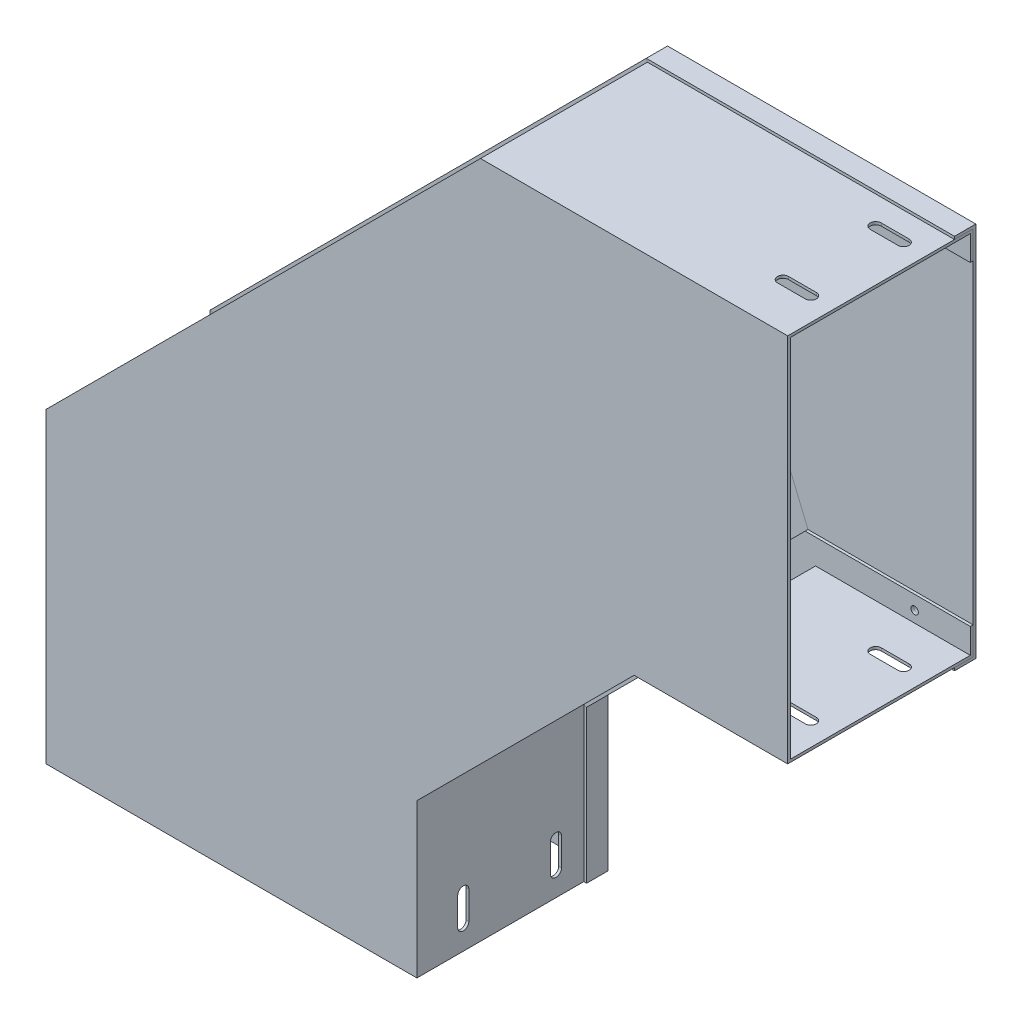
ISO-10303-21;
HEADER;
FILE_DESCRIPTION(('STEP AP214'),'2;1');
FILE_NAME('part.step','',(''),(''),'','','');
FILE_SCHEMA(('AUTOMOTIVE_DESIGN { 1 0 10303 214 1 1 1 1 }'));
ENDSEC;
DATA;
#1=APPLICATION_CONTEXT('core data for automotive mechanical design processes');
#2=APPLICATION_PROTOCOL_DEFINITION('international standard','automotive_design',2000,#1);
#3=PRODUCT_CONTEXT('',#1,'mechanical');
#4=PRODUCT('Part','Part','',(#3));
#5=PRODUCT_RELATED_PRODUCT_CATEGORY('part','',(#4));
#6=PRODUCT_DEFINITION_FORMATION('','',#4);
#7=PRODUCT_DEFINITION_CONTEXT('part definition',#1,'design');
#8=PRODUCT_DEFINITION('design','',#6,#7);
#9=PRODUCT_DEFINITION_SHAPE('','',#8);
#10=(LENGTH_UNIT() NAMED_UNIT(*) SI_UNIT(.MILLI.,.METRE.));
#11=(NAMED_UNIT(*) PLANE_ANGLE_UNIT() SI_UNIT($,.RADIAN.));
#12=(NAMED_UNIT(*) SI_UNIT($,.STERADIAN.) SOLID_ANGLE_UNIT());
#13=UNCERTAINTY_MEASURE_WITH_UNIT(LENGTH_MEASURE(1.E-05),#10,'distance_accuracy_value','');
#14=(GEOMETRIC_REPRESENTATION_CONTEXT(3) GLOBAL_UNCERTAINTY_ASSIGNED_CONTEXT((#13)) GLOBAL_UNIT_ASSIGNED_CONTEXT((#10,
#11,#12)) REPRESENTATION_CONTEXT('',''));
#15=CARTESIAN_POINT('',(0.,0.,0.));
#16=DIRECTION('',(0.,0.,1.));
#17=DIRECTION('',(1.,0.,0.));
#18=AXIS2_PLACEMENT_3D('',#15,#16,#17);
#19=CARTESIAN_POINT('',(-133.923008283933,323.318742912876,-50.0000000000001));
#20=DIRECTION('',(0.,0.,-1.));
#21=DIRECTION('',(0.,1.,0.));
#22=AXIS2_PLACEMENT_3D('',#19,#20,#21);
#23=PLANE('',#22);
#24=CARTESIAN_POINT('',(-29.9999999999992,392.5,-50.0000000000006));
#25=DIRECTION('',(0.,0.,-1.));
#26=DIRECTION('',(0.,1.,0.));
#27=AXIS2_PLACEMENT_3D('',#24,#25,#26);
#28=CIRCLE('',#27,2.00000000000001);
#29=CARTESIAN_POINT('',(-29.9999999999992,394.5,-50.0000000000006));
#30=VERTEX_POINT('',#29);
#31=EDGE_CURVE('E620',#30,#30,#28,.T.);
#32=ORIENTED_EDGE('',*,*,#31,.T.);
#33=EDGE_LOOP('',(#32));
#34=FACE_BOUND('',#33,.T.);
#35=CARTESIAN_POINT('',(-29.9999999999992,207.5,-49.9999999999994));
#36=DIRECTION('',(0.,0.,-1.));
#37=DIRECTION('',(0.,1.,0.));
#38=AXIS2_PLACEMENT_3D('',#35,#36,#37);
#39=CIRCLE('',#38,2.00000000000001);
#40=CARTESIAN_POINT('',(-29.9999999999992,209.5,-49.9999999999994));
#41=VERTEX_POINT('',#40);
#42=EDGE_CURVE('E624',#41,#41,#39,.T.);
#43=ORIENTED_EDGE('',*,*,#42,.T.);
#44=EDGE_LOOP('',(#43));
#45=FACE_BOUND('',#44,.T.);
#46=DIRECTION('',(0.,-1.,0.));
#47=VECTOR('',#46,1.);
#48=CARTESIAN_POINT('',(9.15933995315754E-13,323.318742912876,-50.0000000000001));
#49=LINE('',#48,#47);
#50=CARTESIAN_POINT('',(1.13797860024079E-12,400.,-50.0000000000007));
#51=VERTEX_POINT('',#50);
#52=CARTESIAN_POINT('',(5.13478148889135E-13,200.,-49.9999999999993));
#53=VERTEX_POINT('',#52);
#54=EDGE_CURVE('E57',#51,#53,#49,.T.);
#55=ORIENTED_EDGE('',*,*,#54,.F.);
#56=DIRECTION('',(1.,0.,0.));
#57=VECTOR('',#56,1.);
#58=CARTESIAN_POINT('',(-165.685424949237,400.,-50.0000000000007));
#59=LINE('',#58,#57);
#60=CARTESIAN_POINT('',(-165.685424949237,400.,-50.0000000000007));
#61=VERTEX_POINT('',#60);
#62=EDGE_CURVE('E257',#61,#51,#59,.T.);
#63=ORIENTED_EDGE('',*,*,#62,.F.);
#64=DIRECTION('',(-0.382683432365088,0.923879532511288,0.));
#65=VECTOR('',#64,1.);
#66=CARTESIAN_POINT('',(-133.923008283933,323.318742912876,-50.0000000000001));
#67=LINE('',#66,#65);
#68=CARTESIAN_POINT('',(-82.8427124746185,200.,-49.9999999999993));
#69=VERTEX_POINT('',#68);
#70=EDGE_CURVE('E253',#69,#61,#67,.T.);
#71=ORIENTED_EDGE('',*,*,#70,.F.);
#72=DIRECTION('',(1.,0.,0.));
#73=VECTOR('',#72,1.);
#74=CARTESIAN_POINT('',(-82.8427124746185,200.,-49.9999999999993));
#75=LINE('',#74,#73);
#76=EDGE_CURVE('E278',#69,#53,#75,.T.);
#77=ORIENTED_EDGE('',*,*,#76,.T.);
#78=EDGE_LOOP('',(#55,#63,#71,#77));
#79=FACE_BOUND('',#78,.T.);
#80=ADVANCED_FACE('F48',(#34,#45,#79),#23,.F.);
#81=CARTESIAN_POINT('',(-165.685424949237,400.,-40.0000000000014));
#82=DIRECTION('',(0.,1.,0.));
#83=DIRECTION('',(0.,0.,1.));
#84=AXIS2_PLACEMENT_3D('',#81,#82,#83);
#85=PLANE('',#84);
#86=DIRECTION('',(0.,0.,-1.));
#87=VECTOR('',#86,1.);
#88=CARTESIAN_POINT('',(1.13797860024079E-12,400.,-40.0000000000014));
#89=LINE('',#88,#87);
#90=CARTESIAN_POINT('',(1.15571894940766E-12,399.999999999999,-40.0000000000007));
#91=VERTEX_POINT('',#90);
#92=EDGE_CURVE('E85',#91,#51,#89,.T.);
#93=ORIENTED_EDGE('',*,*,#92,.F.);
#94=DIRECTION('',(1.,0.,0.));
#95=VECTOR('',#94,1.);
#96=CARTESIAN_POINT('',(-165.685424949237,400.,-40.0000000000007));
#97=LINE('',#96,#95);
#98=CARTESIAN_POINT('',(-165.685424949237,400.,-40.0000000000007));
#99=VERTEX_POINT('',#98);
#100=EDGE_CURVE('E260',#99,#91,#97,.T.);
#101=ORIENTED_EDGE('',*,*,#100,.F.);
#102=DIRECTION('',(0.,0.,1.));
#103=VECTOR('',#102,1.);
#104=CARTESIAN_POINT('',(-165.685424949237,400.,-40.0000000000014));
#105=LINE('',#104,#103);
#106=EDGE_CURVE('E256',#61,#99,#105,.T.);
#107=ORIENTED_EDGE('',*,*,#106,.F.);
#108=ORIENTED_EDGE('',*,*,#62,.T.);
#109=EDGE_LOOP('',(#93,#101,#107,#108));
#110=FACE_BOUND('',#109,.T.);
#111=ADVANCED_FACE('F383',(#110),#85,.F.);
#112=CARTESIAN_POINT('',(-133.923008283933,323.318742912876,-40.0000000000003));
#113=DIRECTION('',(0.,0.,-1.));
#114=DIRECTION('',(0.,1.,0.));
#115=AXIS2_PLACEMENT_3D('',#112,#113,#114);
#116=PLANE('',#115);
#117=DIRECTION('',(0.,-1.,0.));
#118=VECTOR('',#117,1.);
#119=CARTESIAN_POINT('',(9.15933995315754E-13,323.318742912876,-40.0000000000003));
#120=LINE('',#119,#118);
#121=CARTESIAN_POINT('',(1.13797860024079E-12,401.5,-40.0000000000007));
#122=VERTEX_POINT('',#121);
#123=EDGE_CURVE('E82',#122,#91,#120,.T.);
#124=ORIENTED_EDGE('',*,*,#123,.F.);
#125=DIRECTION('',(1.,0.,0.));
#126=VECTOR('',#125,1.);
#127=CARTESIAN_POINT('',(-166.306745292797,401.5,-40.0000000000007));
#128=LINE('',#127,#126);
#129=CARTESIAN_POINT('',(-166.306745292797,401.5,-40.0000000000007));
#130=VERTEX_POINT('',#129);
#131=EDGE_CURVE('E264',#130,#122,#128,.T.);
#132=ORIENTED_EDGE('',*,*,#131,.F.);
#133=DIRECTION('',(-0.382683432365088,0.923879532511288,0.));
#134=VECTOR('',#133,1.);
#135=CARTESIAN_POINT('',(-133.923008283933,323.318742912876,-40.0000000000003));
#136=LINE('',#135,#134);
#137=EDGE_CURVE('E308',#99,#130,#136,.T.);
#138=ORIENTED_EDGE('',*,*,#137,.F.);
#139=ORIENTED_EDGE('',*,*,#100,.T.);
#140=EDGE_LOOP('',(#124,#132,#138,#139));
#141=FACE_BOUND('',#140,.T.);
#142=ADVANCED_FACE('F386',(#141),#116,.F.);
#143=CARTESIAN_POINT('',(-166.306745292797,401.5,-40.000000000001));
#144=DIRECTION('',(0.,-1.,0.));
#145=DIRECTION('',(0.,0.,-1.));
#146=AXIS2_PLACEMENT_3D('',#143,#144,#145);
#147=PLANE('',#146);
#148=DIRECTION('',(0.,0.,1.));
#149=VECTOR('',#148,1.);
#150=CARTESIAN_POINT('',(1.13797860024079E-12,401.5,-40.000000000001));
#151=LINE('',#150,#149);
#152=CARTESIAN_POINT('',(1.15757850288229E-12,401.5,-51.5000000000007));
#153=VERTEX_POINT('',#152);
#154=EDGE_CURVE('E79',#153,#122,#151,.T.);
#155=ORIENTED_EDGE('',*,*,#154,.F.);
#156=DIRECTION('',(1.,0.,0.));
#157=VECTOR('',#156,1.);
#158=CARTESIAN_POINT('',(-166.306745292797,401.5,-51.5000000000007));
#159=LINE('',#158,#157);
#160=CARTESIAN_POINT('',(-166.306745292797,401.5,-51.5000000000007));
#161=VERTEX_POINT('',#160);
#162=EDGE_CURVE('E267',#161,#153,#159,.T.);
#163=ORIENTED_EDGE('',*,*,#162,.F.);
#164=DIRECTION('',(0.,0.,-1.));
#165=VECTOR('',#164,1.);
#166=CARTESIAN_POINT('',(-166.306745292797,401.5,-40.000000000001));
#167=LINE('',#166,#165);
#168=EDGE_CURVE('E305',#130,#161,#167,.T.);
#169=ORIENTED_EDGE('',*,*,#168,.F.);
#170=ORIENTED_EDGE('',*,*,#131,.T.);
#171=EDGE_LOOP('',(#155,#163,#169,#170));
#172=FACE_BOUND('',#171,.T.);
#173=ADVANCED_FACE('F367',(#172),#147,.F.);
#174=CARTESIAN_POINT('',(-134.298008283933,324.224072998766,-51.5000000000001));
#175=DIRECTION('',(0.,0.,1.));
#176=DIRECTION('',(0.,-1.,0.));
#177=AXIS2_PLACEMENT_3D('',#174,#175,#176);
#178=PLANE('',#177);
#179=CARTESIAN_POINT('',(-29.9999999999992,392.5,-51.5000000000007));
#180=DIRECTION('',(0.,0.,1.));
#181=DIRECTION('',(1.,0.,0.));
#182=AXIS2_PLACEMENT_3D('',#179,#180,#181);
#183=CIRCLE('',#182,2.00000000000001);
#184=CARTESIAN_POINT('',(-27.9999999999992,392.5,-51.5000000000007));
#185=VERTEX_POINT('',#184);
#186=EDGE_CURVE('E618',#185,#185,#183,.T.);
#187=ORIENTED_EDGE('',*,*,#186,.T.);
#188=EDGE_LOOP('',(#187));
#189=FACE_BOUND('',#188,.T.);
#190=CARTESIAN_POINT('',(-29.9999999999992,207.5,-51.5000000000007));
#191=DIRECTION('',(0.,0.,1.));
#192=DIRECTION('',(1.,0.,0.));
#193=AXIS2_PLACEMENT_3D('',#190,#191,#192);
#194=CIRCLE('',#193,2.00000000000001);
#195=CARTESIAN_POINT('',(-27.9999999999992,207.5,-51.5000000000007));
#196=VERTEX_POINT('',#195);
#197=EDGE_CURVE('E621',#196,#196,#194,.T.);
#198=ORIENTED_EDGE('',*,*,#197,.T.);
#199=EDGE_LOOP('',(#198));
#200=FACE_BOUND('',#199,.T.);
#201=DIRECTION('',(0.,1.,0.));
#202=VECTOR('',#201,1.);
#203=CARTESIAN_POINT('',(9.15933995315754E-13,324.224072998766,-51.5000000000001));
#204=LINE('',#203,#202);
#205=CARTESIAN_POINT('',(5.13478148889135E-13,198.5,-51.4999999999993));
#206=VERTEX_POINT('',#205);
#207=EDGE_CURVE('E285',#206,#153,#204,.T.);
#208=ORIENTED_EDGE('',*,*,#207,.F.);
#209=DIRECTION('',(1.,0.,0.));
#210=VECTOR('',#209,1.);
#211=CARTESIAN_POINT('',(-82.2213921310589,198.5,-51.4999999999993));
#212=LINE('',#211,#210);
#213=CARTESIAN_POINT('',(-82.2213921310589,198.5,-51.4999999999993));
#214=VERTEX_POINT('',#213);
#215=EDGE_CURVE('E270',#214,#206,#212,.T.);
#216=ORIENTED_EDGE('',*,*,#215,.F.);
#217=DIRECTION('',(0.382683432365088,-0.923879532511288,0.));
#218=VECTOR('',#217,1.);
#219=CARTESIAN_POINT('',(-134.298008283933,324.224072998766,-51.5000000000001));
#220=LINE('',#219,#218);
#221=EDGE_CURVE('E302',#161,#214,#220,.T.);
#222=ORIENTED_EDGE('',*,*,#221,.F.);
#223=ORIENTED_EDGE('',*,*,#162,.T.);
#224=EDGE_LOOP('',(#208,#216,#222,#223));
#225=FACE_BOUND('',#224,.T.);
#226=ADVANCED_FACE('F371',(#189,#200,#225),#178,.F.);
#227=CARTESIAN_POINT('',(-82.2213921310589,198.5,-51.4999999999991));
#228=DIRECTION('',(0.,1.,0.));
#229=DIRECTION('',(0.,0.,1.));
#230=AXIS2_PLACEMENT_3D('',#227,#228,#229);
#231=PLANE('',#230);
#232=DIRECTION('',(0.,0.,-1.));
#233=VECTOR('',#232,1.);
#234=CARTESIAN_POINT('',(5.13478148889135E-13,198.5,-51.4999999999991));
#235=LINE('',#234,#233);
#236=CARTESIAN_POINT('',(5.17340874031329E-13,198.499999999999,-39.9999999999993));
#237=VERTEX_POINT('',#236);
#238=EDGE_CURVE('E282',#237,#206,#235,.T.);
#239=ORIENTED_EDGE('',*,*,#238,.F.);
#240=DIRECTION('',(1.,0.,0.));
#241=VECTOR('',#240,1.);
#242=CARTESIAN_POINT('',(-82.2213921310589,198.5,-39.9999999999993));
#243=LINE('',#242,#241);
#244=CARTESIAN_POINT('',(-82.2213921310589,198.5,-39.9999999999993));
#245=VERTEX_POINT('',#244);
#246=EDGE_CURVE('E273',#245,#237,#243,.T.);
#247=ORIENTED_EDGE('',*,*,#246,.F.);
#248=DIRECTION('',(0.,0.,1.));
#249=VECTOR('',#248,1.);
#250=CARTESIAN_POINT('',(-82.2213921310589,198.5,-51.4999999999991));
#251=LINE('',#250,#249);
#252=EDGE_CURVE('E299',#214,#245,#251,.T.);
#253=ORIENTED_EDGE('',*,*,#252,.F.);
#254=ORIENTED_EDGE('',*,*,#215,.T.);
#255=EDGE_LOOP('',(#239,#247,#253,#254));
#256=FACE_BOUND('',#255,.T.);
#257=ADVANCED_FACE('F374',(#256),#231,.F.);
#258=CARTESIAN_POINT('',(-83.5480082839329,201.702734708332,-39.9999999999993));
#259=DIRECTION('',(0.,0.,-1.));
#260=DIRECTION('',(0.,1.,0.));
#261=AXIS2_PLACEMENT_3D('',#258,#259,#260);
#262=PLANE('',#261);
#263=DIRECTION('',(0.,-1.,0.));
#264=VECTOR('',#263,1.);
#265=CARTESIAN_POINT('',(5.27355936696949E-13,201.702734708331,-39.9999999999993));
#266=LINE('',#265,#264);
#267=CARTESIAN_POINT('',(5.13478148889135E-13,200.,-39.9999999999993));
#268=VERTEX_POINT('',#267);
#269=EDGE_CURVE('E279',#268,#237,#266,.T.);
#270=ORIENTED_EDGE('',*,*,#269,.F.);
#271=DIRECTION('',(1.,0.,0.));
#272=VECTOR('',#271,1.);
#273=CARTESIAN_POINT('',(-82.8427124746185,200.,-39.9999999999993));
#274=LINE('',#273,#272);
#275=CARTESIAN_POINT('',(-82.8427124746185,200.,-39.9999999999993));
#276=VERTEX_POINT('',#275);
#277=EDGE_CURVE('E276',#276,#268,#274,.T.);
#278=ORIENTED_EDGE('',*,*,#277,.F.);
#279=DIRECTION('',(-0.382683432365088,0.923879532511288,0.));
#280=VECTOR('',#279,1.);
#281=CARTESIAN_POINT('',(-83.5480082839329,201.702734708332,-39.9999999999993));
#282=LINE('',#281,#280);
#283=EDGE_CURVE('E296',#245,#276,#282,.T.);
#284=ORIENTED_EDGE('',*,*,#283,.F.);
#285=ORIENTED_EDGE('',*,*,#246,.T.);
#286=EDGE_LOOP('',(#270,#278,#284,#285));
#287=FACE_BOUND('',#286,.T.);
#288=ADVANCED_FACE('F377',(#287),#262,.F.);
#289=CARTESIAN_POINT('',(-82.8427124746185,200.,-49.9999999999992));
#290=DIRECTION('',(0.,-1.,0.));
#291=DIRECTION('',(1.,0.,0.));
#292=AXIS2_PLACEMENT_3D('',#289,#290,#291);
#293=PLANE('',#292);
#294=DIRECTION('',(0.,0.,1.));
#295=VECTOR('',#294,1.);
#296=CARTESIAN_POINT('',(5.13478148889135E-13,200.,-49.9999999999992));
#297=LINE('',#296,#295);
#298=EDGE_CURVE('E13',#53,#268,#297,.T.);
#299=ORIENTED_EDGE('',*,*,#298,.F.);
#300=ORIENTED_EDGE('',*,*,#76,.F.);
#301=DIRECTION('',(0.,0.,-1.));
#302=VECTOR('',#301,1.);
#303=CARTESIAN_POINT('',(-82.8427124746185,200.,-49.9999999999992));
#304=LINE('',#303,#302);
#305=EDGE_CURVE('E261',#276,#69,#304,.T.);
#306=ORIENTED_EDGE('',*,*,#305,.F.);
#307=ORIENTED_EDGE('',*,*,#277,.T.);
#308=EDGE_LOOP('',(#299,#300,#306,#307));
#309=FACE_BOUND('',#308,.T.);
#310=ADVANCED_FACE('F50',(#309),#293,.F.);
#311=CARTESIAN_POINT('',(-400.,165.685424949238,-39.9999999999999));
#312=DIRECTION('',(0.707106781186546,-0.707106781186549,0.));
#313=DIRECTION('',(0.707106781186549,0.707106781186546,0.));
#314=AXIS2_PLACEMENT_3D('',#311,#312,#313);
#315=PLANE('',#314);
#316=DIRECTION('',(0.707106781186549,0.707106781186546,0.));
#317=VECTOR('',#316,1.);
#318=CARTESIAN_POINT('',(-400.,165.685424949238,-50.0000000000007));
#319=LINE('',#318,#317);
#320=CARTESIAN_POINT('',(-400.,165.685424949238,-50.0000000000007));
#321=VERTEX_POINT('',#320);
#322=EDGE_CURVE('E250',#321,#61,#319,.T.);
#323=ORIENTED_EDGE('',*,*,#322,.T.);
#324=ORIENTED_EDGE('',*,*,#106,.T.);
#325=DIRECTION('',(0.707106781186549,0.707106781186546,0.));
#326=VECTOR('',#325,1.);
#327=CARTESIAN_POINT('',(-400.,165.685424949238,-40.0000000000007));
#328=LINE('',#327,#326);
#329=CARTESIAN_POINT('',(-400.,165.685424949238,-40.0000000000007));
#330=VERTEX_POINT('',#329);
#331=EDGE_CURVE('E229',#330,#99,#328,.T.);
#332=ORIENTED_EDGE('',*,*,#331,.F.);
#333=DIRECTION('',(0.,0.,-1.));
#334=VECTOR('',#333,1.);
#335=CARTESIAN_POINT('',(-400.,165.685424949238,-39.9999999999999));
#336=LINE('',#335,#334);
#337=EDGE_CURVE('E171',#330,#321,#336,.T.);
#338=ORIENTED_EDGE('',*,*,#337,.T.);
#339=EDGE_LOOP('',(#323,#324,#332,#338));
#340=FACE_BOUND('',#339,.T.);
#341=ADVANCED_FACE('F332',(#340),#315,.T.);
#342=CARTESIAN_POINT('',(-457.24175119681,189.395734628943,-40.0000000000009));
#343=DIRECTION('',(0.,0.,1.));
#344=DIRECTION('',(0.,-1.,0.));
#345=AXIS2_PLACEMENT_3D('',#342,#343,#344);
#346=PLANE('',#345);
#347=ORIENTED_EDGE('',*,*,#331,.T.);
#348=ORIENTED_EDGE('',*,*,#137,.T.);
#349=DIRECTION('',(0.707106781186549,0.707106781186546,0.));
#350=VECTOR('',#349,1.);
#351=CARTESIAN_POINT('',(-401.5,166.306745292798,-40.0000000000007));
#352=LINE('',#351,#350);
#353=CARTESIAN_POINT('',(-401.5,166.306745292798,-40.0000000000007));
#354=VERTEX_POINT('',#353);
#355=EDGE_CURVE('E232',#354,#130,#352,.T.);
#356=ORIENTED_EDGE('',*,*,#355,.F.);
#357=DIRECTION('',(0.923879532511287,-0.382683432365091,0.));
#358=VECTOR('',#357,1.);
#359=CARTESIAN_POINT('',(-457.24175119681,189.395734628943,-40.0000000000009));
#360=LINE('',#359,#358);
#361=EDGE_CURVE('E226',#354,#330,#360,.T.);
#362=ORIENTED_EDGE('',*,*,#361,.T.);
#363=EDGE_LOOP('',(#347,#348,#356,#362));
#364=FACE_BOUND('',#363,.T.);
#365=ADVANCED_FACE('F388',(#364),#346,.T.);
#366=CARTESIAN_POINT('',(-401.5,166.306745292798,-40.0000000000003));
#367=DIRECTION('',(-0.707106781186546,0.707106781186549,0.));
#368=DIRECTION('',(-0.707106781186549,-0.707106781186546,0.));
#369=AXIS2_PLACEMENT_3D('',#366,#367,#368);
#370=PLANE('',#369);
#371=ORIENTED_EDGE('',*,*,#355,.T.);
#372=ORIENTED_EDGE('',*,*,#168,.T.);
#373=DIRECTION('',(0.707106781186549,0.707106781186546,0.));
#374=VECTOR('',#373,1.);
#375=CARTESIAN_POINT('',(-401.5,166.306745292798,-51.5000000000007));
#376=LINE('',#375,#374);
#377=CARTESIAN_POINT('',(-401.5,166.306745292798,-51.5000000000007));
#378=VERTEX_POINT('',#377);
#379=EDGE_CURVE('E235',#378,#161,#376,.T.);
#380=ORIENTED_EDGE('',*,*,#379,.F.);
#381=DIRECTION('',(0.,0.,1.));
#382=VECTOR('',#381,1.);
#383=CARTESIAN_POINT('',(-401.5,166.306745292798,-40.0000000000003));
#384=LINE('',#383,#382);
#385=EDGE_CURVE('E175',#378,#354,#384,.T.);
#386=ORIENTED_EDGE('',*,*,#385,.T.);
#387=EDGE_LOOP('',(#371,#372,#380,#386));
#388=FACE_BOUND('',#387,.T.);
#389=ADVANCED_FACE('F364',(#388),#370,.T.);
#390=CARTESIAN_POINT('',(-458.5220812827,189.926064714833,-51.5000000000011));
#391=DIRECTION('',(0.,0.,-1.));
#392=DIRECTION('',(0.,1.,0.));
#393=AXIS2_PLACEMENT_3D('',#390,#391,#392);
#394=PLANE('',#393);
#395=ORIENTED_EDGE('',*,*,#379,.T.);
#396=ORIENTED_EDGE('',*,*,#221,.T.);
#397=DIRECTION('',(0.707106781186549,0.707106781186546,0.));
#398=VECTOR('',#397,1.);
#399=CARTESIAN_POINT('',(-198.5,82.2213921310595,-51.4999999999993));
#400=LINE('',#399,#398);
#401=CARTESIAN_POINT('',(-198.5,82.2213921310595,-51.4999999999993));
#402=VERTEX_POINT('',#401);
#403=EDGE_CURVE('E238',#402,#214,#400,.T.);
#404=ORIENTED_EDGE('',*,*,#403,.F.);
#405=DIRECTION('',(-0.923879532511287,0.382683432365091,0.));
#406=VECTOR('',#405,1.);
#407=CARTESIAN_POINT('',(-458.5220812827,189.926064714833,-51.5000000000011));
#408=LINE('',#407,#406);
#409=EDGE_CURVE('E315',#402,#378,#408,.T.);
#410=ORIENTED_EDGE('',*,*,#409,.T.);
#411=EDGE_LOOP('',(#395,#396,#404,#410));
#412=FACE_BOUND('',#411,.T.);
#413=ADVANCED_FACE('F360',(#412),#394,.T.);
#414=CARTESIAN_POINT('',(-198.5,82.2213921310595,-51.4999999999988));
#415=DIRECTION('',(0.707106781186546,-0.707106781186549,0.));
#416=DIRECTION('',(0.707106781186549,0.707106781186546,0.));
#417=AXIS2_PLACEMENT_3D('',#414,#415,#416);
#418=PLANE('',#417);
#419=ORIENTED_EDGE('',*,*,#403,.T.);
#420=ORIENTED_EDGE('',*,*,#252,.T.);
#421=DIRECTION('',(0.707106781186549,0.707106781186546,0.));
#422=VECTOR('',#421,1.);
#423=CARTESIAN_POINT('',(-198.5,82.2213921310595,-39.9999999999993));
#424=LINE('',#423,#422);
#425=CARTESIAN_POINT('',(-198.5,82.2213921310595,-39.9999999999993));
#426=VERTEX_POINT('',#425);
#427=EDGE_CURVE('E241',#426,#245,#424,.T.);
#428=ORIENTED_EDGE('',*,*,#427,.F.);
#429=DIRECTION('',(0.,0.,-1.));
#430=VECTOR('',#429,1.);
#431=CARTESIAN_POINT('',(-198.5,82.2213921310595,-51.4999999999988));
#432=LINE('',#431,#430);
#433=EDGE_CURVE('E318',#426,#402,#432,.T.);
#434=ORIENTED_EDGE('',*,*,#433,.T.);
#435=EDGE_LOOP('',(#419,#420,#428,#434));
#436=FACE_BOUND('',#435,.T.);
#437=ADVANCED_FACE('F354',(#436),#418,.T.);
#438=CARTESIAN_POINT('',(-285.250742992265,118.154726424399,-39.9999999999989));
#439=DIRECTION('',(0.,0.,1.));
#440=DIRECTION('',(0.,-1.,0.));
#441=AXIS2_PLACEMENT_3D('',#438,#439,#440);
#442=PLANE('',#441);
#443=ORIENTED_EDGE('',*,*,#427,.T.);
#444=ORIENTED_EDGE('',*,*,#283,.T.);
#445=DIRECTION('',(0.707106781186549,0.707106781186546,0.));
#446=VECTOR('',#445,1.);
#447=CARTESIAN_POINT('',(-200.,82.8427124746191,-39.9999999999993));
#448=LINE('',#447,#446);
#449=CARTESIAN_POINT('',(-200.,82.8427124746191,-39.9999999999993));
#450=VERTEX_POINT('',#449);
#451=EDGE_CURVE('E244',#450,#276,#448,.T.);
#452=ORIENTED_EDGE('',*,*,#451,.F.);
#453=DIRECTION('',(0.923879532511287,-0.382683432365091,0.));
#454=VECTOR('',#453,1.);
#455=CARTESIAN_POINT('',(-285.250742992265,118.154726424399,-39.9999999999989));
#456=LINE('',#455,#454);
#457=EDGE_CURVE('E321',#450,#426,#456,.T.);
#458=ORIENTED_EDGE('',*,*,#457,.T.);
#459=EDGE_LOOP('',(#443,#444,#452,#458));
#460=FACE_BOUND('',#459,.T.);
#461=ADVANCED_FACE('F348',(#460),#442,.T.);
#462=CARTESIAN_POINT('',(-200.,82.8427124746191,-49.999999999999));
#463=DIRECTION('',(-0.707106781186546,0.707106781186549,0.));
#464=DIRECTION('',(-0.707106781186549,-0.707106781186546,0.));
#465=AXIS2_PLACEMENT_3D('',#462,#463,#464);
#466=PLANE('',#465);
#467=ORIENTED_EDGE('',*,*,#451,.T.);
#468=ORIENTED_EDGE('',*,*,#305,.T.);
#469=DIRECTION('',(0.707106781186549,0.707106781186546,0.));
#470=VECTOR('',#469,1.);
#471=CARTESIAN_POINT('',(-200.,82.8427124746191,-49.9999999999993));
#472=LINE('',#471,#470);
#473=CARTESIAN_POINT('',(-200.,82.8427124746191,-49.9999999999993));
#474=VERTEX_POINT('',#473);
#475=EDGE_CURVE('E247',#474,#69,#472,.T.);
#476=ORIENTED_EDGE('',*,*,#475,.F.);
#477=DIRECTION('',(0.,0.,1.));
#478=VECTOR('',#477,1.);
#479=CARTESIAN_POINT('',(-200.,82.8427124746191,-49.999999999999));
#480=LINE('',#479,#478);
#481=EDGE_CURVE('E324',#474,#450,#480,.T.);
#482=ORIENTED_EDGE('',*,*,#481,.T.);
#483=EDGE_LOOP('',(#467,#468,#476,#482));
#484=FACE_BOUND('',#483,.T.);
#485=ADVANCED_FACE('F342',(#484),#466,.T.);
#486=CARTESIAN_POINT('',(-457.24175119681,189.395734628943,-50.000000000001));
#487=DIRECTION('',(0.,0.,1.));
#488=DIRECTION('',(0.,-1.,0.));
#489=AXIS2_PLACEMENT_3D('',#486,#487,#488);
#490=PLANE('',#489);
#491=ORIENTED_EDGE('',*,*,#475,.T.);
#492=ORIENTED_EDGE('',*,*,#70,.T.);
#493=ORIENTED_EDGE('',*,*,#322,.F.);
#494=DIRECTION('',(0.923879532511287,-0.382683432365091,0.));
#495=VECTOR('',#494,1.);
#496=CARTESIAN_POINT('',(-457.24175119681,189.395734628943,-50.000000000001));
#497=LINE('',#496,#495);
#498=EDGE_CURVE('E326',#321,#474,#497,.T.);
#499=ORIENTED_EDGE('',*,*,#498,.T.);
#500=EDGE_LOOP('',(#491,#492,#493,#499));
#501=FACE_BOUND('',#500,.T.);
#502=ADVANCED_FACE('F380',(#501),#490,.T.);
#503=CARTESIAN_POINT('',(-400.,327.589546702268,-40.0000000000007));
#504=DIRECTION('',(-1.,0.,0.));
#505=DIRECTION('',(0.,0.,1.));
#506=AXIS2_PLACEMENT_3D('',#503,#504,#505);
#507=PLANE('',#506);
#508=ORIENTED_EDGE('',*,*,#337,.F.);
#509=DIRECTION('',(0.,-1.,0.));
#510=VECTOR('',#509,1.);
#511=CARTESIAN_POINT('',(-400.,327.589546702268,-40.0000000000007));
#512=LINE('',#511,#510);
#513=CARTESIAN_POINT('',(-400.,0.,-40.0000000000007));
#514=VERTEX_POINT('',#513);
#515=EDGE_CURVE('E164',#330,#514,#512,.T.);
#516=ORIENTED_EDGE('',*,*,#515,.T.);
#517=DIRECTION('',(0.,0.,-1.));
#518=VECTOR('',#517,1.);
#519=CARTESIAN_POINT('',(-400.,0.,-40.0000000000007));
#520=LINE('',#519,#518);
#521=CARTESIAN_POINT('',(-400.,0.,-50.0000000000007));
#522=VERTEX_POINT('',#521);
#523=EDGE_CURVE('E168',#514,#522,#520,.T.);
#524=ORIENTED_EDGE('',*,*,#523,.T.);
#525=DIRECTION('',(0.,-1.,0.));
#526=VECTOR('',#525,1.);
#527=CARTESIAN_POINT('',(-400.,327.589546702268,-50.0000000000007));
#528=LINE('',#527,#526);
#529=EDGE_CURVE('E176',#321,#522,#528,.T.);
#530=ORIENTED_EDGE('',*,*,#529,.F.);
#531=EDGE_LOOP('',(#508,#516,#524,#530));
#532=FACE_BOUND('',#531,.T.);
#533=ADVANCED_FACE('F166',(#532),#507,.F.);
#534=CARTESIAN_POINT('',(-400.,327.589546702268,-50.0000000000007));
#535=DIRECTION('',(0.,0.,-1.));
#536=DIRECTION('',(-1.,0.,0.));
#537=AXIS2_PLACEMENT_3D('',#534,#535,#536);
#538=PLANE('',#537);
#539=CARTESIAN_POINT('',(-207.5,30.,-49.9999999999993));
#540=DIRECTION('',(0.,0.,-1.));
#541=DIRECTION('',(-1.,0.,0.));
#542=AXIS2_PLACEMENT_3D('',#539,#540,#541);
#543=CIRCLE('',#542,2.);
#544=CARTESIAN_POINT('',(-209.5,30.,-49.9999999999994));
#545=VERTEX_POINT('',#544);
#546=EDGE_CURVE('E191',#545,#545,#543,.T.);
#547=ORIENTED_EDGE('',*,*,#546,.T.);
#548=EDGE_LOOP('',(#547));
#549=FACE_BOUND('',#548,.T.);
#550=CARTESIAN_POINT('',(-392.5,30.,-50.0000000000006));
#551=DIRECTION('',(0.,0.,-1.));
#552=DIRECTION('',(-1.,0.,0.));
#553=AXIS2_PLACEMENT_3D('',#550,#551,#552);
#554=CIRCLE('',#553,2.);
#555=CARTESIAN_POINT('',(-394.5,30.,-50.0000000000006));
#556=VERTEX_POINT('',#555);
#557=EDGE_CURVE('E194',#556,#556,#554,.T.);
#558=ORIENTED_EDGE('',*,*,#557,.T.);
#559=EDGE_LOOP('',(#558));
#560=FACE_BOUND('',#559,.T.);
#561=ORIENTED_EDGE('',*,*,#498,.F.);
#562=ORIENTED_EDGE('',*,*,#529,.T.);
#563=DIRECTION('',(1.,0.,0.));
#564=VECTOR('',#563,1.);
#565=CARTESIAN_POINT('',(-400.,0.,-50.0000000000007));
#566=LINE('',#565,#564);
#567=CARTESIAN_POINT('',(-200.,0.,-49.9999999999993));
#568=VERTEX_POINT('',#567);
#569=EDGE_CURVE('E185',#522,#568,#566,.T.);
#570=ORIENTED_EDGE('',*,*,#569,.T.);
#571=DIRECTION('',(0.,-1.,0.));
#572=VECTOR('',#571,1.);
#573=CARTESIAN_POINT('',(-200.,327.589546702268,-49.9999999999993));
#574=LINE('',#573,#572);
#575=EDGE_CURVE('E223',#474,#568,#574,.T.);
#576=ORIENTED_EDGE('',*,*,#575,.F.);
#577=EDGE_LOOP('',(#561,#562,#570,#576));
#578=FACE_BOUND('',#577,.T.);
#579=ADVANCED_FACE('F335',(#549,#560,#578),#538,.F.);
#580=CARTESIAN_POINT('',(-200.,327.589546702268,-49.9999999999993));
#581=DIRECTION('',(1.,0.,0.));
#582=DIRECTION('',(0.,0.,-1.));
#583=AXIS2_PLACEMENT_3D('',#580,#581,#582);
#584=PLANE('',#583);
#585=ORIENTED_EDGE('',*,*,#481,.F.);
#586=ORIENTED_EDGE('',*,*,#575,.T.);
#587=DIRECTION('',(0.,0.,1.));
#588=VECTOR('',#587,1.);
#589=CARTESIAN_POINT('',(-200.,0.,-49.9999999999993));
#590=LINE('',#589,#588);
#591=CARTESIAN_POINT('',(-200.,0.,-39.9999999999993));
#592=VERTEX_POINT('',#591);
#593=EDGE_CURVE('E200',#568,#592,#590,.T.);
#594=ORIENTED_EDGE('',*,*,#593,.T.);
#595=DIRECTION('',(0.,-1.,0.));
#596=VECTOR('',#595,1.);
#597=CARTESIAN_POINT('',(-200.,327.589546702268,-39.9999999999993));
#598=LINE('',#597,#596);
#599=EDGE_CURVE('E221',#450,#592,#598,.T.);
#600=ORIENTED_EDGE('',*,*,#599,.F.);
#601=EDGE_LOOP('',(#585,#586,#594,#600));
#602=FACE_BOUND('',#601,.T.);
#603=ADVANCED_FACE('F337',(#602),#584,.F.);
#604=CARTESIAN_POINT('',(-198.5,327.589546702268,-39.9999999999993));
#605=DIRECTION('',(0.,0.,-1.));
#606=DIRECTION('',(-1.,0.,0.));
#607=AXIS2_PLACEMENT_3D('',#604,#605,#606);
#608=PLANE('',#607);
#609=ORIENTED_EDGE('',*,*,#457,.F.);
#610=ORIENTED_EDGE('',*,*,#599,.T.);
#611=DIRECTION('',(1.,0.,0.));
#612=VECTOR('',#611,1.);
#613=CARTESIAN_POINT('',(-198.5,0.,-39.9999999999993));
#614=LINE('',#613,#612);
#615=CARTESIAN_POINT('',(-198.5,0.,-39.9999999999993));
#616=VERTEX_POINT('',#615);
#617=EDGE_CURVE('E203',#592,#616,#614,.T.);
#618=ORIENTED_EDGE('',*,*,#617,.T.);
#619=DIRECTION('',(0.,-1.,0.));
#620=VECTOR('',#619,1.);
#621=CARTESIAN_POINT('',(-198.5,327.589546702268,-39.9999999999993));
#622=LINE('',#621,#620);
#623=EDGE_CURVE('E219',#426,#616,#622,.T.);
#624=ORIENTED_EDGE('',*,*,#623,.F.);
#625=EDGE_LOOP('',(#609,#610,#618,#624));
#626=FACE_BOUND('',#625,.T.);
#627=ADVANCED_FACE('F345',(#626),#608,.F.);
#628=CARTESIAN_POINT('',(-198.5,327.589546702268,-51.4999999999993));
#629=DIRECTION('',(-1.,0.,0.));
#630=DIRECTION('',(0.,0.,1.));
#631=AXIS2_PLACEMENT_3D('',#628,#629,#630);
#632=PLANE('',#631);
#633=ORIENTED_EDGE('',*,*,#433,.F.);
#634=ORIENTED_EDGE('',*,*,#623,.T.);
#635=DIRECTION('',(0.,0.,-1.));
#636=VECTOR('',#635,1.);
#637=CARTESIAN_POINT('',(-198.5,0.,-51.4999999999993));
#638=LINE('',#637,#636);
#639=CARTESIAN_POINT('',(-198.5,0.,-51.4999999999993));
#640=VERTEX_POINT('',#639);
#641=EDGE_CURVE('E206',#616,#640,#638,.T.);
#642=ORIENTED_EDGE('',*,*,#641,.T.);
#643=DIRECTION('',(0.,-1.,0.));
#644=VECTOR('',#643,1.);
#645=CARTESIAN_POINT('',(-198.5,327.589546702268,-51.4999999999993));
#646=LINE('',#645,#644);
#647=EDGE_CURVE('E217',#402,#640,#646,.T.);
#648=ORIENTED_EDGE('',*,*,#647,.F.);
#649=EDGE_LOOP('',(#633,#634,#642,#648));
#650=FACE_BOUND('',#649,.T.);
#651=ADVANCED_FACE('F351',(#650),#632,.F.);
#652=CARTESIAN_POINT('',(-401.5,327.589546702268,-51.5000000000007));
#653=DIRECTION('',(0.,0.,1.));
#654=DIRECTION('',(1.,0.,0.));
#655=AXIS2_PLACEMENT_3D('',#652,#653,#654);
#656=PLANE('',#655);
#657=CARTESIAN_POINT('',(-207.5,30.,-51.5000000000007));
#658=DIRECTION('',(0.,0.,1.));
#659=DIRECTION('',(1.,0.,0.));
#660=AXIS2_PLACEMENT_3D('',#657,#658,#659);
#661=CIRCLE('',#660,2.);
#662=CARTESIAN_POINT('',(-205.5,30.,-51.5000000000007));
#663=VERTEX_POINT('',#662);
#664=EDGE_CURVE('E631',#663,#663,#661,.T.);
#665=ORIENTED_EDGE('',*,*,#664,.T.);
#666=EDGE_LOOP('',(#665));
#667=FACE_BOUND('',#666,.T.);
#668=CARTESIAN_POINT('',(-392.5,30.,-51.5000000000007));
#669=DIRECTION('',(0.,0.,1.));
#670=DIRECTION('',(1.,0.,0.));
#671=AXIS2_PLACEMENT_3D('',#668,#669,#670);
#672=CIRCLE('',#671,2.);
#673=CARTESIAN_POINT('',(-390.5,30.,-51.5000000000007));
#674=VERTEX_POINT('',#673);
#675=EDGE_CURVE('E630',#674,#674,#672,.T.);
#676=ORIENTED_EDGE('',*,*,#675,.T.);
#677=EDGE_LOOP('',(#676));
#678=FACE_BOUND('',#677,.T.);
#679=ORIENTED_EDGE('',*,*,#409,.F.);
#680=ORIENTED_EDGE('',*,*,#647,.T.);
#681=DIRECTION('',(-1.,0.,0.));
#682=VECTOR('',#681,1.);
#683=CARTESIAN_POINT('',(-401.5,0.,-51.5000000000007));
#684=LINE('',#683,#682);
#685=CARTESIAN_POINT('',(-401.5,0.,-51.5000000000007));
#686=VERTEX_POINT('',#685);
#687=EDGE_CURVE('E209',#640,#686,#684,.T.);
#688=ORIENTED_EDGE('',*,*,#687,.T.);
#689=DIRECTION('',(0.,-1.,0.));
#690=VECTOR('',#689,1.);
#691=CARTESIAN_POINT('',(-401.5,327.589546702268,-51.5000000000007));
#692=LINE('',#691,#690);
#693=EDGE_CURVE('E215',#378,#686,#692,.T.);
#694=ORIENTED_EDGE('',*,*,#693,.F.);
#695=EDGE_LOOP('',(#679,#680,#688,#694));
#696=FACE_BOUND('',#695,.T.);
#697=ADVANCED_FACE('F357',(#667,#678,#696),#656,.F.);
#698=CARTESIAN_POINT('',(-401.5,327.589546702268,-40.0000000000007));
#699=DIRECTION('',(1.,0.,0.));
#700=DIRECTION('',(0.,0.,-1.));
#701=AXIS2_PLACEMENT_3D('',#698,#699,#700);
#702=PLANE('',#701);
#703=ORIENTED_EDGE('',*,*,#385,.F.);
#704=ORIENTED_EDGE('',*,*,#693,.T.);
#705=DIRECTION('',(0.,0.,1.));
#706=VECTOR('',#705,1.);
#707=CARTESIAN_POINT('',(-401.5,0.,-40.0000000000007));
#708=LINE('',#707,#706);
#709=CARTESIAN_POINT('',(-401.5,0.,-40.0000000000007));
#710=VERTEX_POINT('',#709);
#711=EDGE_CURVE('E212',#686,#710,#708,.T.);
#712=ORIENTED_EDGE('',*,*,#711,.T.);
#713=DIRECTION('',(0.,-1.,0.));
#714=VECTOR('',#713,1.);
#715=CARTESIAN_POINT('',(-401.5,327.589546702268,-40.0000000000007));
#716=LINE('',#715,#714);
#717=EDGE_CURVE('E189',#354,#710,#716,.T.);
#718=ORIENTED_EDGE('',*,*,#717,.F.);
#719=EDGE_LOOP('',(#703,#704,#712,#718));
#720=FACE_BOUND('',#719,.T.);
#721=ADVANCED_FACE('F362',(#720),#702,.F.);
#722=CARTESIAN_POINT('',(-400.,327.589546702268,-40.0000000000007));
#723=DIRECTION('',(0.,0.,-1.));
#724=DIRECTION('',(-1.,0.,0.));
#725=AXIS2_PLACEMENT_3D('',#722,#723,#724);
#726=PLANE('',#725);
#727=ORIENTED_EDGE('',*,*,#361,.F.);
#728=ORIENTED_EDGE('',*,*,#717,.T.);
#729=DIRECTION('',(1.,0.,0.));
#730=VECTOR('',#729,1.);
#731=CARTESIAN_POINT('',(-400.,0.,-40.0000000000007));
#732=LINE('',#731,#730);
#733=EDGE_CURVE('E182',#710,#514,#732,.T.);
#734=ORIENTED_EDGE('',*,*,#733,.T.);
#735=ORIENTED_EDGE('',*,*,#515,.F.);
#736=EDGE_LOOP('',(#727,#728,#734,#735));
#737=FACE_BOUND('',#736,.T.);
#738=ADVANCED_FACE('F187',(#737),#726,.F.);
#739=CARTESIAN_POINT('',(0.,0.,0.));
#740=DIRECTION('',(0.,-1.,0.));
#741=DIRECTION('',(0.,0.,-1.));
#742=AXIS2_PLACEMENT_3D('',#739,#740,#741);
#743=PLANE('',#742);
#744=ORIENTED_EDGE('',*,*,#733,.F.);
#745=ORIENTED_EDGE('',*,*,#711,.F.);
#746=ORIENTED_EDGE('',*,*,#687,.F.);
#747=ORIENTED_EDGE('',*,*,#641,.F.);
#748=ORIENTED_EDGE('',*,*,#617,.F.);
#749=ORIENTED_EDGE('',*,*,#593,.F.);
#750=ORIENTED_EDGE('',*,*,#569,.F.);
#751=ORIENTED_EDGE('',*,*,#523,.F.);
#752=EDGE_LOOP('',(#744,#745,#746,#747,#748,#749,#750,#751));
#753=FACE_BOUND('',#752,.T.);
#754=ADVANCED_FACE('F180',(#753),#743,.T.);
#755=CARTESIAN_POINT('',(8.32667268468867E-13,300.,-45.75));
#756=DIRECTION('',(1.,0.,0.));
#757=DIRECTION('',(0.,1.,0.));
#758=AXIS2_PLACEMENT_3D('',#755,#756,#757);
#759=PLANE('',#758);
#760=ORIENTED_EDGE('',*,*,#54,.T.);
#761=ORIENTED_EDGE('',*,*,#298,.T.);
#762=ORIENTED_EDGE('',*,*,#269,.T.);
#763=ORIENTED_EDGE('',*,*,#238,.T.);
#764=ORIENTED_EDGE('',*,*,#207,.T.);
#765=ORIENTED_EDGE('',*,*,#154,.T.);
#766=ORIENTED_EDGE('',*,*,#123,.T.);
#767=ORIENTED_EDGE('',*,*,#92,.T.);
#768=EDGE_LOOP('',(#760,#761,#762,#763,#764,#765,#766,#767));
#769=FACE_BOUND('',#768,.T.);
#770=ADVANCED_FACE('F536',(#769),#759,.T.);
#771=CARTESIAN_POINT('',(-392.5,30.,-51.5000000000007));
#772=DIRECTION('',(0.,0.,1.));
#773=DIRECTION('',(1.,0.,0.));
#774=AXIS2_PLACEMENT_3D('',#771,#772,#773);
#775=CYLINDRICAL_SURFACE('',#774,2.);
#776=ORIENTED_EDGE('',*,*,#675,.F.);
#777=EDGE_LOOP('',(#776));
#778=FACE_BOUND('',#777,.T.);
#779=ORIENTED_EDGE('',*,*,#557,.F.);
#780=EDGE_LOOP('',(#779));
#781=FACE_BOUND('',#780,.T.);
#782=ADVANCED_FACE('F545',(#778,#781),#775,.F.);
#783=CARTESIAN_POINT('',(-207.5,30.,-51.5000000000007));
#784=DIRECTION('',(0.,0.,1.));
#785=DIRECTION('',(1.,0.,0.));
#786=AXIS2_PLACEMENT_3D('',#783,#784,#785);
#787=CYLINDRICAL_SURFACE('',#786,2.);
#788=ORIENTED_EDGE('',*,*,#664,.F.);
#789=EDGE_LOOP('',(#788));
#790=FACE_BOUND('',#789,.T.);
#791=ORIENTED_EDGE('',*,*,#546,.F.);
#792=EDGE_LOOP('',(#791));
#793=FACE_BOUND('',#792,.T.);
#794=ADVANCED_FACE('F568',(#790,#793),#787,.F.);
#795=CARTESIAN_POINT('',(-29.9999999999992,207.5,-51.5000000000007));
#796=DIRECTION('',(0.,0.,1.));
#797=DIRECTION('',(1.,0.,0.));
#798=AXIS2_PLACEMENT_3D('',#795,#796,#797);
#799=CYLINDRICAL_SURFACE('',#798,2.00000000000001);
#800=ORIENTED_EDGE('',*,*,#197,.F.);
#801=EDGE_LOOP('',(#800));
#802=FACE_BOUND('',#801,.T.);
#803=ORIENTED_EDGE('',*,*,#42,.F.);
#804=EDGE_LOOP('',(#803));
#805=FACE_BOUND('',#804,.T.);
#806=ADVANCED_FACE('F577',(#802,#805),#799,.F.);
#807=CARTESIAN_POINT('',(-29.9999999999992,392.5,-51.5000000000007));
#808=DIRECTION('',(0.,0.,1.));
#809=DIRECTION('',(1.,0.,0.));
#810=AXIS2_PLACEMENT_3D('',#807,#808,#809);
#811=CYLINDRICAL_SURFACE('',#810,2.00000000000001);
#812=ORIENTED_EDGE('',*,*,#186,.F.);
#813=EDGE_LOOP('',(#812));
#814=FACE_BOUND('',#813,.T.);
#815=ORIENTED_EDGE('',*,*,#31,.F.);
#816=EDGE_LOOP('',(#815));
#817=FACE_BOUND('',#816,.T.);
#818=ADVANCED_FACE('F601',(#814,#817),#811,.F.);
#819=CLOSED_SHELL('',(#80,#111,#142,#173,#226,#257,#288,#310,#341,#365,#389,#413,#437,#461,#485,
#502,#533,#579,#603,#627,#651,#697,#721,#738,#754,#770,#782,#794,#806,#818));
#820=MANIFOLD_SOLID_BREP('B2',#819);
#821=CARTESIAN_POINT('',(-83.4640328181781,201.5,48.499999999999));
#822=DIRECTION('',(0.,-1.,0.));
#823=DIRECTION('',(0.,0.,-1.));
#824=AXIS2_PLACEMENT_3D('',#821,#822,#823);
#825=PLANE('',#824);
#826=DIRECTION('',(1.,0.,0.));
#827=VECTOR('',#826,1.);
#828=CARTESIAN_POINT('',(-83.4640328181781,201.5,-27.9999999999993));
#829=LINE('',#828,#827);
#830=CARTESIAN_POINT('',(-27.4999999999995,201.5,-27.9999999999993));
#831=VERTEX_POINT('',#830);
#832=CARTESIAN_POINT('',(-12.4999999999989,201.5,-27.9999999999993));
#833=VERTEX_POINT('',#832);
#834=EDGE_CURVE('E1072',#831,#833,#829,.T.);
#835=ORIENTED_EDGE('',*,*,#834,.T.);
#836=CARTESIAN_POINT('',(-12.4999999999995,201.5,-24.9999999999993));
#837=DIRECTION('',(0.,-1.,0.));
#838=DIRECTION('',(0.,0.,-1.));
#839=AXIS2_PLACEMENT_3D('',#836,#837,#838);
#840=CIRCLE('',#839,3.);
#841=CARTESIAN_POINT('',(-12.4999999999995,201.5,-21.9999999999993));
#842=VERTEX_POINT('',#841);
#843=EDGE_CURVE('E1090',#833,#842,#840,.T.);
#844=ORIENTED_EDGE('',*,*,#843,.T.);
#845=DIRECTION('',(-1.,0.,0.));
#846=VECTOR('',#845,1.);
#847=CARTESIAN_POINT('',(-83.4640328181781,201.5,-21.9999999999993));
#848=LINE('',#847,#846);
#849=CARTESIAN_POINT('',(-27.4999999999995,201.5,-21.9999999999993));
#850=VERTEX_POINT('',#849);
#851=EDGE_CURVE('E1084',#842,#850,#848,.T.);
#852=ORIENTED_EDGE('',*,*,#851,.T.);
#853=CARTESIAN_POINT('',(-27.4999999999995,201.5,-24.9999999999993));
#854=DIRECTION('',(0.,-1.,0.));
#855=DIRECTION('',(0.,0.,-1.));
#856=AXIS2_PLACEMENT_3D('',#853,#854,#855);
#857=CIRCLE('',#856,3.);
#858=EDGE_CURVE('E1078',#850,#831,#857,.T.);
#859=ORIENTED_EDGE('',*,*,#858,.T.);
#860=EDGE_LOOP('',(#835,#844,#852,#859));
#861=FACE_BOUND('',#860,.T.);
#862=DIRECTION('',(1.,0.,0.));
#863=VECTOR('',#862,1.);
#864=CARTESIAN_POINT('',(-83.4640328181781,201.5,22.0000000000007));
#865=LINE('',#864,#863);
#866=CARTESIAN_POINT('',(-27.4999999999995,201.5,22.0000000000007));
#867=VERTEX_POINT('',#866);
#868=CARTESIAN_POINT('',(-12.4999999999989,201.5,22.0000000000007));
#869=VERTEX_POINT('',#868);
#870=EDGE_CURVE('E1120',#867,#869,#865,.T.);
#871=ORIENTED_EDGE('',*,*,#870,.T.);
#872=CARTESIAN_POINT('',(-12.4999999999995,201.5,25.0000000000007));
#873=DIRECTION('',(0.,-1.,0.));
#874=DIRECTION('',(0.,0.,-1.));
#875=AXIS2_PLACEMENT_3D('',#872,#873,#874);
#876=CIRCLE('',#875,3.);
#877=CARTESIAN_POINT('',(-12.4999999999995,201.5,28.0000000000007));
#878=VERTEX_POINT('',#877);
#879=EDGE_CURVE('E1138',#869,#878,#876,.T.);
#880=ORIENTED_EDGE('',*,*,#879,.T.);
#881=DIRECTION('',(-1.,0.,0.));
#882=VECTOR('',#881,1.);
#883=CARTESIAN_POINT('',(-83.4640328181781,201.5,28.0000000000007));
#884=LINE('',#883,#882);
#885=CARTESIAN_POINT('',(-27.4999999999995,201.5,28.0000000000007));
#886=VERTEX_POINT('',#885);
#887=EDGE_CURVE('E1132',#878,#886,#884,.T.);
#888=ORIENTED_EDGE('',*,*,#887,.T.);
#889=CARTESIAN_POINT('',(-27.4999999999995,201.5,25.0000000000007));
#890=DIRECTION('',(0.,-1.,0.));
#891=DIRECTION('',(0.,0.,-1.));
#892=AXIS2_PLACEMENT_3D('',#889,#890,#891);
#893=CIRCLE('',#892,3.);
#894=EDGE_CURVE('E1126',#886,#867,#893,.T.);
#895=ORIENTED_EDGE('',*,*,#894,.T.);
#896=EDGE_LOOP('',(#871,#880,#888,#895));
#897=FACE_BOUND('',#896,.T.);
#898=DIRECTION('',(0.,0.,1.));
#899=VECTOR('',#898,1.);
#900=CARTESIAN_POINT('',(5.27355936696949E-13,201.5,48.499999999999));
#901=LINE('',#900,#899);
#902=CARTESIAN_POINT('',(5.21359258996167E-13,201.499999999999,-48.5000000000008));
#903=VERTEX_POINT('',#902);
#904=CARTESIAN_POINT('',(5.27355936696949E-13,201.5,48.4999999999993));
#905=VERTEX_POINT('',#904);
#906=EDGE_CURVE('E1263',#903,#905,#901,.T.);
#907=ORIENTED_EDGE('',*,*,#906,.F.);
#908=DIRECTION('',(1.,0.,0.));
#909=VECTOR('',#908,1.);
#910=CARTESIAN_POINT('',(-83.4640328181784,201.500000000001,-48.5000000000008));
#911=LINE('',#910,#909);
#912=CARTESIAN_POINT('',(-83.4640328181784,201.500000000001,-48.5000000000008));
#913=VERTEX_POINT('',#912);
#914=EDGE_CURVE('E1402',#913,#903,#911,.T.);
#915=ORIENTED_EDGE('',*,*,#914,.F.);
#916=DIRECTION('',(0.,0.,-1.));
#917=VECTOR('',#916,1.);
#918=CARTESIAN_POINT('',(-83.4640328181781,201.5,48.499999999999));
#919=LINE('',#918,#917);
#920=CARTESIAN_POINT('',(-83.4640328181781,201.5,48.4999999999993));
#921=VERTEX_POINT('',#920);
#922=EDGE_CURVE('E1284',#921,#913,#919,.T.);
#923=ORIENTED_EDGE('',*,*,#922,.F.);
#924=DIRECTION('',(1.,0.,0.));
#925=VECTOR('',#924,1.);
#926=CARTESIAN_POINT('',(-83.4640328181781,201.5,48.4999999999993));
#927=LINE('',#926,#925);
#928=EDGE_CURVE('E1271',#921,#905,#927,.T.);
#929=ORIENTED_EDGE('',*,*,#928,.T.);
#930=EDGE_LOOP('',(#907,#915,#923,#929));
#931=FACE_BOUND('',#930,.T.);
#932=ADVANCED_FACE('F679',(#861,#897,#931),#825,.F.);
#933=CARTESIAN_POINT('',(-89.0559159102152,215.000000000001,-50.0000000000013));
#934=DIRECTION('',(0.,-1.,0.));
#935=DIRECTION('',(0.,0.,-1.));
#936=AXIS2_PLACEMENT_3D('',#933,#934,#935);
#937=PLANE('',#936);
#938=DIRECTION('',(0.,0.,1.));
#939=VECTOR('',#938,1.);
#940=CARTESIAN_POINT('',(5.68989300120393E-13,215.,-50.0000000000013));
#941=LINE('',#940,#939);
#942=CARTESIAN_POINT('',(5.64128638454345E-13,215.000000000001,-50.0000000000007));
#943=VERTEX_POINT('',#942);
#944=CARTESIAN_POINT('',(5.68989300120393E-13,215.,-48.5000000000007));
#945=VERTEX_POINT('',#944);
#946=EDGE_CURVE('E1259',#943,#945,#941,.T.);
#947=ORIENTED_EDGE('',*,*,#946,.F.);
#948=DIRECTION('',(1.,0.,0.));
#949=VECTOR('',#948,1.);
#950=CARTESIAN_POINT('',(-89.0559159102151,215.000000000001,-50.0000000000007));
#951=LINE('',#950,#949);
#952=CARTESIAN_POINT('',(-89.0559159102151,215.000000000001,-50.0000000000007));
#953=VERTEX_POINT('',#952);
#954=EDGE_CURVE('E1408',#953,#943,#951,.T.);
#955=ORIENTED_EDGE('',*,*,#954,.F.);
#956=DIRECTION('',(0.,0.,-1.));
#957=VECTOR('',#956,1.);
#958=CARTESIAN_POINT('',(-89.0559159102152,215.000000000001,-50.0000000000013));
#959=LINE('',#958,#957);
#960=CARTESIAN_POINT('',(-89.0559159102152,215.000000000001,-48.5000000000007));
#961=VERTEX_POINT('',#960);
#962=EDGE_CURVE('E1281',#961,#953,#959,.T.);
#963=ORIENTED_EDGE('',*,*,#962,.F.);
#964=DIRECTION('',(1.,0.,0.));
#965=VECTOR('',#964,1.);
#966=CARTESIAN_POINT('',(-89.0559159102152,215.000000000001,-48.5000000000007));
#967=LINE('',#966,#965);
#968=EDGE_CURVE('E1405',#961,#945,#967,.T.);
#969=ORIENTED_EDGE('',*,*,#968,.T.);
#970=EDGE_LOOP('',(#947,#955,#963,#969));
#971=FACE_BOUND('',#970,.T.);
#972=ADVANCED_FACE('F1529',(#971),#937,.F.);
#973=CARTESIAN_POINT('',(-82.8427124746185,200.,49.999999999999));
#974=DIRECTION('',(0.,1.,0.));
#975=DIRECTION('',(0.,0.,1.));
#976=AXIS2_PLACEMENT_3D('',#973,#974,#975);
#977=PLANE('',#976);
#978=DIRECTION('',(1.,0.,0.));
#979=VECTOR('',#978,1.);
#980=CARTESIAN_POINT('',(-82.8427124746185,200.,-21.9999999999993));
#981=LINE('',#980,#979);
#982=CARTESIAN_POINT('',(-27.4999999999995,200.,-21.9999999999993));
#983=VERTEX_POINT('',#982);
#984=CARTESIAN_POINT('',(-12.4999999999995,200.,-21.9999999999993));
#985=VERTEX_POINT('',#984);
#986=EDGE_CURVE('E1081',#983,#985,#981,.T.);
#987=ORIENTED_EDGE('',*,*,#986,.T.);
#988=CARTESIAN_POINT('',(-12.4999999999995,200.,-24.9999999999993));
#989=DIRECTION('',(0.,1.,0.));
#990=DIRECTION('',(0.,0.,1.));
#991=AXIS2_PLACEMENT_3D('',#988,#989,#990);
#992=CIRCLE('',#991,3.);
#993=CARTESIAN_POINT('',(-12.4999999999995,200.,-27.9999999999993));
#994=VERTEX_POINT('',#993);
#995=EDGE_CURVE('E1087',#985,#994,#992,.T.);
#996=ORIENTED_EDGE('',*,*,#995,.T.);
#997=DIRECTION('',(-1.,0.,0.));
#998=VECTOR('',#997,1.);
#999=CARTESIAN_POINT('',(-82.8427124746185,200.,-27.9999999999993));
#1000=LINE('',#999,#998);
#1001=CARTESIAN_POINT('',(-27.5000000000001,200.,-27.9999999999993));
#1002=VERTEX_POINT('',#1001);
#1003=EDGE_CURVE('E1069',#994,#1002,#1000,.T.);
#1004=ORIENTED_EDGE('',*,*,#1003,.T.);
#1005=CARTESIAN_POINT('',(-27.4999999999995,200.,-24.9999999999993));
#1006=DIRECTION('',(0.,1.,0.));
#1007=DIRECTION('',(0.,0.,1.));
#1008=AXIS2_PLACEMENT_3D('',#1005,#1006,#1007);
#1009=CIRCLE('',#1008,3.);
#1010=EDGE_CURVE('E1075',#1002,#983,#1009,.T.);
#1011=ORIENTED_EDGE('',*,*,#1010,.T.);
#1012=EDGE_LOOP('',(#987,#996,#1004,#1011));
#1013=FACE_BOUND('',#1012,.T.);
#1014=DIRECTION('',(1.,0.,0.));
#1015=VECTOR('',#1014,1.);
#1016=CARTESIAN_POINT('',(-82.8427124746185,200.,28.0000000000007));
#1017=LINE('',#1016,#1015);
#1018=CARTESIAN_POINT('',(-27.4999999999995,200.,28.0000000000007));
#1019=VERTEX_POINT('',#1018);
#1020=CARTESIAN_POINT('',(-12.4999999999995,200.,28.0000000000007));
#1021=VERTEX_POINT('',#1020);
#1022=EDGE_CURVE('E1129',#1019,#1021,#1017,.T.);
#1023=ORIENTED_EDGE('',*,*,#1022,.T.);
#1024=CARTESIAN_POINT('',(-12.4999999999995,200.,25.0000000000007));
#1025=DIRECTION('',(0.,1.,0.));
#1026=DIRECTION('',(0.,0.,1.));
#1027=AXIS2_PLACEMENT_3D('',#1024,#1025,#1026);
#1028=CIRCLE('',#1027,3.);
#1029=CARTESIAN_POINT('',(-12.4999999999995,200.,22.0000000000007));
#1030=VERTEX_POINT('',#1029);
#1031=EDGE_CURVE('E1135',#1021,#1030,#1028,.T.);
#1032=ORIENTED_EDGE('',*,*,#1031,.T.);
#1033=DIRECTION('',(-1.,0.,0.));
#1034=VECTOR('',#1033,1.);
#1035=CARTESIAN_POINT('',(-82.8427124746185,200.,22.0000000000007));
#1036=LINE('',#1035,#1034);
#1037=CARTESIAN_POINT('',(-27.5000000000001,200.,22.0000000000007));
#1038=VERTEX_POINT('',#1037);
#1039=EDGE_CURVE('E1117',#1030,#1038,#1036,.T.);
#1040=ORIENTED_EDGE('',*,*,#1039,.T.);
#1041=CARTESIAN_POINT('',(-27.4999999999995,200.,25.0000000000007));
#1042=DIRECTION('',(0.,1.,0.));
#1043=DIRECTION('',(0.,0.,1.));
#1044=AXIS2_PLACEMENT_3D('',#1041,#1042,#1043);
#1045=CIRCLE('',#1044,3.);
#1046=EDGE_CURVE('E1123',#1038,#1019,#1045,.T.);
#1047=ORIENTED_EDGE('',*,*,#1046,.T.);
#1048=EDGE_LOOP('',(#1023,#1032,#1040,#1047));
#1049=FACE_BOUND('',#1048,.T.);
#1050=DIRECTION('',(0.,0.,-1.));
#1051=VECTOR('',#1050,1.);
#1052=CARTESIAN_POINT('',(5.13478148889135E-13,200.,49.999999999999));
#1053=LINE('',#1052,#1051);
#1054=CARTESIAN_POINT('',(5.17223117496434E-13,199.999999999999,49.9999999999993));
#1055=VERTEX_POINT('',#1054);
#1056=CARTESIAN_POINT('',(5.13478148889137E-13,200.,-50.0000000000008));
#1057=VERTEX_POINT('',#1056);
#1058=EDGE_CURVE('E1255',#1055,#1057,#1053,.T.);
#1059=ORIENTED_EDGE('',*,*,#1058,.F.);
#1060=DIRECTION('',(1.,0.,0.));
#1061=VECTOR('',#1060,1.);
#1062=CARTESIAN_POINT('',(-82.8427124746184,200.,49.9999999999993));
#1063=LINE('',#1062,#1061);
#1064=CARTESIAN_POINT('',(-82.8427124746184,200.,49.9999999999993));
#1065=VERTEX_POINT('',#1064);
#1066=EDGE_CURVE('E1414',#1065,#1055,#1063,.T.);
#1067=ORIENTED_EDGE('',*,*,#1066,.F.);
#1068=DIRECTION('',(0.,0.,1.));
#1069=VECTOR('',#1068,1.);
#1070=CARTESIAN_POINT('',(-82.8427124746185,200.,49.999999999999));
#1071=LINE('',#1070,#1069);
#1072=CARTESIAN_POINT('',(-82.8427124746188,200.000000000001,-50.0000000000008));
#1073=VERTEX_POINT('',#1072);
#1074=EDGE_CURVE('E1278',#1073,#1065,#1071,.T.);
#1075=ORIENTED_EDGE('',*,*,#1074,.F.);
#1076=DIRECTION('',(1.,0.,0.));
#1077=VECTOR('',#1076,1.);
#1078=CARTESIAN_POINT('',(-82.8427124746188,200.000000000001,-50.0000000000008));
#1079=LINE('',#1078,#1077);
#1080=EDGE_CURVE('E1411',#1073,#1057,#1079,.T.);
#1081=ORIENTED_EDGE('',*,*,#1080,.T.);
#1082=EDGE_LOOP('',(#1059,#1067,#1075,#1081));
#1083=FACE_BOUND('',#1082,.T.);
#1084=ADVANCED_FACE('F1535',(#1013,#1049,#1083),#977,.F.);
#1085=CARTESIAN_POINT('',(-165.685424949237,400.,50.0000000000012));
#1086=DIRECTION('',(0.,-1.,0.));
#1087=DIRECTION('',(0.,0.,-1.));
#1088=AXIS2_PLACEMENT_3D('',#1085,#1086,#1087);
#1089=PLANE('',#1088);
#1090=DIRECTION('',(-1.,0.,0.));
#1091=VECTOR('',#1090,1.);
#1092=CARTESIAN_POINT('',(-12.4999999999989,400.000000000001,-27.9999999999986));
#1093=LINE('',#1092,#1091);
#1094=CARTESIAN_POINT('',(-12.4999999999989,400.,-27.9999999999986));
#1095=VERTEX_POINT('',#1094);
#1096=CARTESIAN_POINT('',(-27.4999999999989,400.000000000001,-27.9999999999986));
#1097=VERTEX_POINT('',#1096);
#1098=EDGE_CURVE('E1046',#1095,#1097,#1093,.T.);
#1099=ORIENTED_EDGE('',*,*,#1098,.F.);
#1100=CARTESIAN_POINT('',(-12.4999999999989,400.000000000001,-24.9999999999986));
#1101=DIRECTION('',(0.,1.,0.));
#1102=DIRECTION('',(0.,0.,1.));
#1103=AXIS2_PLACEMENT_3D('',#1100,#1101,#1102);
#1104=CIRCLE('',#1103,3.);
#1105=CARTESIAN_POINT('',(-12.4999999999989,400.000000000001,-21.9999999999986));
#1106=VERTEX_POINT('',#1105);
#1107=EDGE_CURVE('E1052',#1106,#1095,#1104,.T.);
#1108=ORIENTED_EDGE('',*,*,#1107,.F.);
#1109=DIRECTION('',(1.,0.,0.));
#1110=VECTOR('',#1109,1.);
#1111=CARTESIAN_POINT('',(-12.4999999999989,400.000000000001,-21.9999999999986));
#1112=LINE('',#1111,#1110);
#1113=CARTESIAN_POINT('',(-27.4999999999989,400.000000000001,-21.9999999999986));
#1114=VERTEX_POINT('',#1113);
#1115=EDGE_CURVE('E1057',#1114,#1106,#1112,.T.);
#1116=ORIENTED_EDGE('',*,*,#1115,.F.);
#1117=CARTESIAN_POINT('',(-27.4999999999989,400.000000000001,-24.9999999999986));
#1118=DIRECTION('',(0.,1.,0.));
#1119=DIRECTION('',(0.,0.,1.));
#1120=AXIS2_PLACEMENT_3D('',#1117,#1118,#1119);
#1121=CIRCLE('',#1120,3.);
#1122=EDGE_CURVE('E1037',#1097,#1114,#1121,.T.);
#1123=ORIENTED_EDGE('',*,*,#1122,.F.);
#1124=EDGE_LOOP('',(#1099,#1108,#1116,#1123));
#1125=FACE_BOUND('',#1124,.T.);
#1126=DIRECTION('',(-1.,0.,0.));
#1127=VECTOR('',#1126,1.);
#1128=CARTESIAN_POINT('',(-12.4999999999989,400.000000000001,22.0000000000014));
#1129=LINE('',#1128,#1127);
#1130=CARTESIAN_POINT('',(-12.4999999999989,400.,22.0000000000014));
#1131=VERTEX_POINT('',#1130);
#1132=CARTESIAN_POINT('',(-27.4999999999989,400.000000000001,22.0000000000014));
#1133=VERTEX_POINT('',#1132);
#1134=EDGE_CURVE('E1095',#1131,#1133,#1129,.T.);
#1135=ORIENTED_EDGE('',*,*,#1134,.F.);
#1136=CARTESIAN_POINT('',(-12.4999999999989,400.000000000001,25.0000000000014));
#1137=DIRECTION('',(0.,1.,0.));
#1138=DIRECTION('',(0.,0.,1.));
#1139=AXIS2_PLACEMENT_3D('',#1136,#1137,#1138);
#1140=CIRCLE('',#1139,3.);
#1141=CARTESIAN_POINT('',(-12.4999999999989,400.000000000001,28.0000000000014));
#1142=VERTEX_POINT('',#1141);
#1143=EDGE_CURVE('E1093',#1142,#1131,#1140,.T.);
#1144=ORIENTED_EDGE('',*,*,#1143,.F.);
#1145=DIRECTION('',(1.,0.,0.));
#1146=VECTOR('',#1145,1.);
#1147=CARTESIAN_POINT('',(-12.4999999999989,400.000000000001,28.0000000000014));
#1148=LINE('',#1147,#1146);
#1149=CARTESIAN_POINT('',(-27.4999999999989,400.000000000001,28.0000000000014));
#1150=VERTEX_POINT('',#1149);
#1151=EDGE_CURVE('E1101',#1150,#1142,#1148,.T.);
#1152=ORIENTED_EDGE('',*,*,#1151,.F.);
#1153=CARTESIAN_POINT('',(-27.4999999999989,400.000000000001,25.0000000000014));
#1154=DIRECTION('',(0.,1.,0.));
#1155=DIRECTION('',(0.,0.,1.));
#1156=AXIS2_PLACEMENT_3D('',#1153,#1154,#1155);
#1157=CIRCLE('',#1156,3.);
#1158=EDGE_CURVE('E1098',#1133,#1150,#1157,.T.);
#1159=ORIENTED_EDGE('',*,*,#1158,.F.);
#1160=EDGE_LOOP('',(#1135,#1144,#1152,#1159));
#1161=FACE_BOUND('',#1160,.T.);
#1162=DIRECTION('',(0.,0.,1.));
#1163=VECTOR('',#1162,1.);
#1164=CARTESIAN_POINT('',(1.13797860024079E-12,400.,50.0000000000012));
#1165=LINE('',#1164,#1163);
#1166=CARTESIAN_POINT('',(1.13986385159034E-12,400.000000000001,-49.9999999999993));
#1167=VERTEX_POINT('',#1166);
#1168=CARTESIAN_POINT('',(1.13797860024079E-12,400.,50.0000000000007));
#1169=VERTEX_POINT('',#1168);
#1170=EDGE_CURVE('E1251',#1167,#1169,#1165,.T.);
#1171=ORIENTED_EDGE('',*,*,#1170,.F.);
#1172=DIRECTION('',(1.,0.,0.));
#1173=VECTOR('',#1172,1.);
#1174=CARTESIAN_POINT('',(-165.685424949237,400.000000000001,-49.9999999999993));
#1175=LINE('',#1174,#1173);
#1176=CARTESIAN_POINT('',(-165.685424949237,400.000000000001,-49.9999999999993));
#1177=VERTEX_POINT('',#1176);
#1178=EDGE_CURVE('E1420',#1177,#1167,#1175,.T.);
#1179=ORIENTED_EDGE('',*,*,#1178,.F.);
#1180=DIRECTION('',(0.,0.,-1.));
#1181=VECTOR('',#1180,1.);
#1182=CARTESIAN_POINT('',(-165.685424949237,400.,50.0000000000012));
#1183=LINE('',#1182,#1181);
#1184=CARTESIAN_POINT('',(-165.685424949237,400.,50.0000000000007));
#1185=VERTEX_POINT('',#1184);
#1186=EDGE_CURVE('E1275',#1185,#1177,#1183,.T.);
#1187=ORIENTED_EDGE('',*,*,#1186,.F.);
#1188=DIRECTION('',(1.,0.,0.));
#1189=VECTOR('',#1188,1.);
#1190=CARTESIAN_POINT('',(-165.685424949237,400.,50.0000000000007));
#1191=LINE('',#1190,#1189);
#1192=EDGE_CURVE('E1417',#1185,#1169,#1191,.T.);
#1193=ORIENTED_EDGE('',*,*,#1192,.T.);
#1194=EDGE_LOOP('',(#1171,#1179,#1187,#1193));
#1195=FACE_BOUND('',#1194,.T.);
#1196=ADVANCED_FACE('F1054',(#1125,#1161,#1195),#1089,.F.);
#1197=CARTESIAN_POINT('',(-159.472221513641,385.000000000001,-48.4999999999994));
#1198=DIRECTION('',(0.,1.,0.));
#1199=DIRECTION('',(-1.,0.,0.));
#1200=AXIS2_PLACEMENT_3D('',#1197,#1198,#1199);
#1201=PLANE('',#1200);
#1202=DIRECTION('',(0.,0.,-1.));
#1203=VECTOR('',#1202,1.);
#1204=CARTESIAN_POINT('',(1.11022302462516E-12,385.,-48.4999999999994));
#1205=LINE('',#1204,#1203);
#1206=CARTESIAN_POINT('',(1.09351274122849E-12,385.,-48.4999999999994));
#1207=VERTEX_POINT('',#1206);
#1208=CARTESIAN_POINT('',(1.11022302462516E-12,385.,-49.9999999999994));
#1209=VERTEX_POINT('',#1208);
#1210=EDGE_CURVE('E1246',#1207,#1209,#1205,.T.);
#1211=ORIENTED_EDGE('',*,*,#1210,.F.);
#1212=DIRECTION('',(1.,0.,0.));
#1213=VECTOR('',#1212,1.);
#1214=CARTESIAN_POINT('',(-159.472221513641,385.000000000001,-48.4999999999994));
#1215=LINE('',#1214,#1213);
#1216=CARTESIAN_POINT('',(-159.472221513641,385.000000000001,-48.4999999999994));
#1217=VERTEX_POINT('',#1216);
#1218=EDGE_CURVE('E1426',#1217,#1207,#1215,.T.);
#1219=ORIENTED_EDGE('',*,*,#1218,.F.);
#1220=DIRECTION('',(0.,0.,1.));
#1221=VECTOR('',#1220,1.);
#1222=CARTESIAN_POINT('',(-159.472221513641,385.000000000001,-48.4999999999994));
#1223=LINE('',#1222,#1221);
#1224=CARTESIAN_POINT('',(-159.472221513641,385.000000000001,-49.9999999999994));
#1225=VERTEX_POINT('',#1224);
#1226=EDGE_CURVE('E1272',#1225,#1217,#1223,.T.);
#1227=ORIENTED_EDGE('',*,*,#1226,.F.);
#1228=DIRECTION('',(1.,0.,0.));
#1229=VECTOR('',#1228,1.);
#1230=CARTESIAN_POINT('',(-159.472221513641,385.000000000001,-49.9999999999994));
#1231=LINE('',#1230,#1229);
#1232=EDGE_CURVE('E1423',#1225,#1209,#1231,.T.);
#1233=ORIENTED_EDGE('',*,*,#1232,.T.);
#1234=EDGE_LOOP('',(#1211,#1219,#1227,#1233));
#1235=FACE_BOUND('',#1234,.T.);
#1236=ADVANCED_FACE('F1587',(#1235),#1201,.F.);
#1237=CARTESIAN_POINT('',(-165.064104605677,398.5,48.5000000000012));
#1238=DIRECTION('',(0.,1.,0.));
#1239=DIRECTION('',(0.,0.,1.));
#1240=AXIS2_PLACEMENT_3D('',#1237,#1238,#1239);
#1241=PLANE('',#1240);
#1242=DIRECTION('',(1.,0.,0.));
#1243=VECTOR('',#1242,1.);
#1244=CARTESIAN_POINT('',(-165.064104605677,398.500000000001,-21.9999999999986));
#1245=LINE('',#1244,#1243);
#1246=CARTESIAN_POINT('',(-27.4999999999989,398.5,-21.9999999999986));
#1247=VERTEX_POINT('',#1246);
#1248=CARTESIAN_POINT('',(-12.4999999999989,398.5,-21.9999999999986));
#1249=VERTEX_POINT('',#1248);
#1250=EDGE_CURVE('E688',#1247,#1249,#1245,.T.);
#1251=ORIENTED_EDGE('',*,*,#1250,.T.);
#1252=CARTESIAN_POINT('',(-12.4999999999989,398.5,-24.9999999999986));
#1253=DIRECTION('',(0.,1.,0.));
#1254=DIRECTION('',(0.,0.,1.));
#1255=AXIS2_PLACEMENT_3D('',#1252,#1253,#1254);
#1256=CIRCLE('',#1255,3.);
#1257=CARTESIAN_POINT('',(-12.4999999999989,398.5,-27.9999999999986));
#1258=VERTEX_POINT('',#1257);
#1259=EDGE_CURVE('E46',#1249,#1258,#1256,.T.);
#1260=ORIENTED_EDGE('',*,*,#1259,.T.);
#1261=DIRECTION('',(-1.,0.,0.));
#1262=VECTOR('',#1261,1.);
#1263=CARTESIAN_POINT('',(-165.064104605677,398.500000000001,-27.9999999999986));
#1264=LINE('',#1263,#1262);
#1265=CARTESIAN_POINT('',(-27.5000000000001,398.5,-27.9999999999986));
#1266=VERTEX_POINT('',#1265);
#1267=EDGE_CURVE('E1471',#1258,#1266,#1264,.T.);
#1268=ORIENTED_EDGE('',*,*,#1267,.T.);
#1269=CARTESIAN_POINT('',(-27.4999999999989,398.5,-24.9999999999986));
#1270=DIRECTION('',(0.,1.,0.));
#1271=DIRECTION('',(0.,0.,1.));
#1272=AXIS2_PLACEMENT_3D('',#1269,#1270,#1271);
#1273=CIRCLE('',#1272,3.);
#1274=EDGE_CURVE('E1040',#1266,#1247,#1273,.T.);
#1275=ORIENTED_EDGE('',*,*,#1274,.T.);
#1276=EDGE_LOOP('',(#1251,#1260,#1268,#1275));
#1277=FACE_BOUND('',#1276,.T.);
#1278=DIRECTION('',(1.,0.,0.));
#1279=VECTOR('',#1278,1.);
#1280=CARTESIAN_POINT('',(-165.064104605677,398.5,28.0000000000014));
#1281=LINE('',#1280,#1279);
#1282=CARTESIAN_POINT('',(-27.4999999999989,398.5,28.0000000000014));
#1283=VERTEX_POINT('',#1282);
#1284=CARTESIAN_POINT('',(-12.4999999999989,398.5,28.0000000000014));
#1285=VERTEX_POINT('',#1284);
#1286=EDGE_CURVE('E1465',#1283,#1285,#1281,.T.);
#1287=ORIENTED_EDGE('',*,*,#1286,.T.);
#1288=CARTESIAN_POINT('',(-12.4999999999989,398.5,25.0000000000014));
#1289=DIRECTION('',(0.,1.,0.));
#1290=DIRECTION('',(0.,0.,1.));
#1291=AXIS2_PLACEMENT_3D('',#1288,#1289,#1290);
#1292=CIRCLE('',#1291,3.);
#1293=CARTESIAN_POINT('',(-12.4999999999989,398.5,22.0000000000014));
#1294=VERTEX_POINT('',#1293);
#1295=EDGE_CURVE('E1468',#1285,#1294,#1292,.T.);
#1296=ORIENTED_EDGE('',*,*,#1295,.T.);
#1297=DIRECTION('',(-1.,0.,0.));
#1298=VECTOR('',#1297,1.);
#1299=CARTESIAN_POINT('',(-165.064104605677,398.5,22.0000000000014));
#1300=LINE('',#1299,#1298);
#1301=CARTESIAN_POINT('',(-27.5000000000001,398.5,22.0000000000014));
#1302=VERTEX_POINT('',#1301);
#1303=EDGE_CURVE('E1459',#1294,#1302,#1300,.T.);
#1304=ORIENTED_EDGE('',*,*,#1303,.T.);
#1305=CARTESIAN_POINT('',(-27.4999999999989,398.5,25.0000000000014));
#1306=DIRECTION('',(0.,1.,0.));
#1307=DIRECTION('',(0.,0.,1.));
#1308=AXIS2_PLACEMENT_3D('',#1305,#1306,#1307);
#1309=CIRCLE('',#1308,3.);
#1310=EDGE_CURVE('E1462',#1302,#1283,#1309,.T.);
#1311=ORIENTED_EDGE('',*,*,#1310,.T.);
#1312=EDGE_LOOP('',(#1287,#1296,#1304,#1311));
#1313=FACE_BOUND('',#1312,.T.);
#1314=DIRECTION('',(0.,0.,-1.));
#1315=VECTOR('',#1314,1.);
#1316=CARTESIAN_POINT('',(1.13797860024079E-12,398.5,48.5000000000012));
#1317=LINE('',#1316,#1315);
#1318=CARTESIAN_POINT('',(1.13797860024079E-12,398.5,48.5000000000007));
#1319=VERTEX_POINT('',#1318);
#1320=CARTESIAN_POINT('',(1.13797860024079E-12,398.5,-48.4999999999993));
#1321=VERTEX_POINT('',#1320);
#1322=EDGE_CURVE('E1267',#1319,#1321,#1317,.T.);
#1323=ORIENTED_EDGE('',*,*,#1322,.F.);
#1324=DIRECTION('',(1.,0.,0.));
#1325=VECTOR('',#1324,1.);
#1326=CARTESIAN_POINT('',(-165.064104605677,398.5,48.5000000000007));
#1327=LINE('',#1326,#1325);
#1328=CARTESIAN_POINT('',(-165.064104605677,398.5,48.5000000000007));
#1329=VERTEX_POINT('',#1328);
#1330=EDGE_CURVE('E1247',#1329,#1319,#1327,.T.);
#1331=ORIENTED_EDGE('',*,*,#1330,.F.);
#1332=DIRECTION('',(0.,0.,1.));
#1333=VECTOR('',#1332,1.);
#1334=CARTESIAN_POINT('',(-165.064104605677,398.5,48.5000000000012));
#1335=LINE('',#1334,#1333);
#1336=CARTESIAN_POINT('',(-165.064104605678,398.500000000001,-48.4999999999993));
#1337=VERTEX_POINT('',#1336);
#1338=EDGE_CURVE('E1268',#1337,#1329,#1335,.T.);
#1339=ORIENTED_EDGE('',*,*,#1338,.F.);
#1340=DIRECTION('',(1.,0.,0.));
#1341=VECTOR('',#1340,1.);
#1342=CARTESIAN_POINT('',(-165.064104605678,398.500000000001,-48.4999999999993));
#1343=LINE('',#1342,#1341);
#1344=EDGE_CURVE('E1429',#1337,#1321,#1343,.T.);
#1345=ORIENTED_EDGE('',*,*,#1344,.T.);
#1346=EDGE_LOOP('',(#1323,#1331,#1339,#1345));
#1347=FACE_BOUND('',#1346,.T.);
#1348=ADVANCED_FACE('F681',(#1277,#1313,#1347),#1241,.F.);
#1349=CARTESIAN_POINT('',(-201.5,83.4640328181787,48.4999999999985));
#1350=DIRECTION('',(-0.707106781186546,0.707106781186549,0.));
#1351=DIRECTION('',(-0.707106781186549,-0.707106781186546,0.));
#1352=AXIS2_PLACEMENT_3D('',#1349,#1350,#1351);
#1353=PLANE('',#1352);
#1354=DIRECTION('',(0.707106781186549,0.707106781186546,0.));
#1355=VECTOR('',#1354,1.);
#1356=CARTESIAN_POINT('',(-201.5,83.4640328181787,48.4999999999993));
#1357=LINE('',#1356,#1355);
#1358=CARTESIAN_POINT('',(-201.5,83.4640328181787,48.4999999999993));
#1359=VERTEX_POINT('',#1358);
#1360=EDGE_CURVE('E1287',#1359,#921,#1357,.T.);
#1361=ORIENTED_EDGE('',*,*,#1360,.T.);
#1362=ORIENTED_EDGE('',*,*,#922,.T.);
#1363=DIRECTION('',(0.707106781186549,0.707106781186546,0.));
#1364=VECTOR('',#1363,1.);
#1365=CARTESIAN_POINT('',(-201.5,83.464032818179,-48.5000000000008));
#1366=LINE('',#1365,#1364);
#1367=CARTESIAN_POINT('',(-201.5,83.464032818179,-48.5000000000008));
#1368=VERTEX_POINT('',#1367);
#1369=EDGE_CURVE('E1307',#1368,#913,#1366,.T.);
#1370=ORIENTED_EDGE('',*,*,#1369,.F.);
#1371=DIRECTION('',(0.,0.,1.));
#1372=VECTOR('',#1371,1.);
#1373=CARTESIAN_POINT('',(-201.5,83.4640328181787,48.4999999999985));
#1374=LINE('',#1373,#1372);
#1375=EDGE_CURVE('E1304',#1368,#1359,#1374,.T.);
#1376=ORIENTED_EDGE('',*,*,#1375,.T.);
#1377=EDGE_LOOP('',(#1361,#1362,#1370,#1376));
#1378=FACE_BOUND('',#1377,.T.);
#1379=ADVANCED_FACE('F1630',(#1378),#1353,.T.);
#1380=CARTESIAN_POINT('',(-215.,89.0559159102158,-50.0000000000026));
#1381=DIRECTION('',(-0.707106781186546,0.707106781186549,0.));
#1382=DIRECTION('',(-0.707106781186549,-0.707106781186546,0.));
#1383=AXIS2_PLACEMENT_3D('',#1380,#1381,#1382);
#1384=PLANE('',#1383);
#1385=DIRECTION('',(0.707106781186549,0.707106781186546,0.));
#1386=VECTOR('',#1385,1.);
#1387=CARTESIAN_POINT('',(-215.,89.0559159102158,-48.5000000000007));
#1388=LINE('',#1387,#1386);
#1389=CARTESIAN_POINT('',(-215.,89.0559159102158,-48.5000000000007));
#1390=VERTEX_POINT('',#1389);
#1391=EDGE_CURVE('E1368',#1390,#961,#1388,.T.);
#1392=ORIENTED_EDGE('',*,*,#1391,.T.);
#1393=ORIENTED_EDGE('',*,*,#962,.T.);
#1394=DIRECTION('',(0.707106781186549,0.707106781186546,0.));
#1395=VECTOR('',#1394,1.);
#1396=CARTESIAN_POINT('',(-215.,89.0559159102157,-50.0000000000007));
#1397=LINE('',#1396,#1395);
#1398=CARTESIAN_POINT('',(-215.,89.0559159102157,-50.0000000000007));
#1399=VERTEX_POINT('',#1398);
#1400=EDGE_CURVE('E1371',#1399,#953,#1397,.T.);
#1401=ORIENTED_EDGE('',*,*,#1400,.F.);
#1402=DIRECTION('',(0.,0.,1.));
#1403=VECTOR('',#1402,1.);
#1404=CARTESIAN_POINT('',(-215.,89.0559159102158,-50.0000000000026));
#1405=LINE('',#1404,#1403);
#1406=EDGE_CURVE('E1301',#1399,#1390,#1405,.T.);
#1407=ORIENTED_EDGE('',*,*,#1406,.T.);
#1408=EDGE_LOOP('',(#1392,#1393,#1401,#1407));
#1409=FACE_BOUND('',#1408,.T.);
#1410=ADVANCED_FACE('F1525',(#1409),#1384,.T.);
#1411=CARTESIAN_POINT('',(-200.,82.842712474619,49.9999999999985));
#1412=DIRECTION('',(0.707106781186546,-0.707106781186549,0.));
#1413=DIRECTION('',(0.707106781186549,0.707106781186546,0.));
#1414=AXIS2_PLACEMENT_3D('',#1411,#1412,#1413);
#1415=PLANE('',#1414);
#1416=DIRECTION('',(0.707106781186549,0.707106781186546,0.));
#1417=VECTOR('',#1416,1.);
#1418=CARTESIAN_POINT('',(-200.,82.8427124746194,-50.0000000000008));
#1419=LINE('',#1418,#1417);
#1420=CARTESIAN_POINT('',(-200.,82.8427124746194,-50.0000000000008));
#1421=VERTEX_POINT('',#1420);
#1422=EDGE_CURVE('E1374',#1421,#1073,#1419,.T.);
#1423=ORIENTED_EDGE('',*,*,#1422,.T.);
#1424=ORIENTED_EDGE('',*,*,#1074,.T.);
#1425=DIRECTION('',(0.707106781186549,0.707106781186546,0.));
#1426=VECTOR('',#1425,1.);
#1427=CARTESIAN_POINT('',(-200.,82.842712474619,49.9999999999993));
#1428=LINE('',#1427,#1426);
#1429=CARTESIAN_POINT('',(-200.,82.842712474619,49.9999999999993));
#1430=VERTEX_POINT('',#1429);
#1431=EDGE_CURVE('E1377',#1430,#1065,#1428,.T.);
#1432=ORIENTED_EDGE('',*,*,#1431,.F.);
#1433=DIRECTION('',(0.,0.,-1.));
#1434=VECTOR('',#1433,1.);
#1435=CARTESIAN_POINT('',(-200.,82.842712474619,49.9999999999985));
#1436=LINE('',#1435,#1434);
#1437=EDGE_CURVE('E1298',#1430,#1421,#1436,.T.);
#1438=ORIENTED_EDGE('',*,*,#1437,.T.);
#1439=EDGE_LOOP('',(#1423,#1424,#1432,#1438));
#1440=FACE_BOUND('',#1439,.T.);
#1441=ADVANCED_FACE('F1537',(#1440),#1415,.T.);
#1442=CARTESIAN_POINT('',(-400.,165.685424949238,50.0000000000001));
#1443=DIRECTION('',(-0.707106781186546,0.707106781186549,0.));
#1444=DIRECTION('',(-0.707106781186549,-0.707106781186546,0.));
#1445=AXIS2_PLACEMENT_3D('',#1442,#1443,#1444);
#1446=PLANE('',#1445);
#1447=DIRECTION('',(0.707106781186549,0.707106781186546,0.));
#1448=VECTOR('',#1447,1.);
#1449=CARTESIAN_POINT('',(-400.,165.685424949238,50.0000000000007));
#1450=LINE('',#1449,#1448);
#1451=CARTESIAN_POINT('',(-400.,165.685424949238,50.0000000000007));
#1452=VERTEX_POINT('',#1451);
#1453=EDGE_CURVE('E1380',#1452,#1185,#1450,.T.);
#1454=ORIENTED_EDGE('',*,*,#1453,.T.);
#1455=ORIENTED_EDGE('',*,*,#1186,.T.);
#1456=DIRECTION('',(0.707106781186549,0.707106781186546,0.));
#1457=VECTOR('',#1456,1.);
#1458=CARTESIAN_POINT('',(-400.,165.685424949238,-49.9999999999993));
#1459=LINE('',#1458,#1457);
#1460=CARTESIAN_POINT('',(-400.,165.685424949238,-49.9999999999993));
#1461=VERTEX_POINT('',#1460);
#1462=EDGE_CURVE('E1383',#1461,#1177,#1459,.T.);
#1463=ORIENTED_EDGE('',*,*,#1462,.F.);
#1464=DIRECTION('',(0.,0.,1.));
#1465=VECTOR('',#1464,1.);
#1466=CARTESIAN_POINT('',(-400.,165.685424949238,50.0000000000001));
#1467=LINE('',#1466,#1465);
#1468=EDGE_CURVE('E1295',#1461,#1452,#1467,.T.);
#1469=ORIENTED_EDGE('',*,*,#1468,.T.);
#1470=EDGE_LOOP('',(#1454,#1455,#1463,#1469));
#1471=FACE_BOUND('',#1470,.T.);
#1472=ADVANCED_FACE('F1603',(#1471),#1446,.T.);
#1473=CARTESIAN_POINT('',(-385.,159.472221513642,-48.4999999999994));
#1474=DIRECTION('',(0.707106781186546,-0.707106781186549,0.));
#1475=DIRECTION('',(0.707106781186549,0.707106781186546,0.));
#1476=AXIS2_PLACEMENT_3D('',#1473,#1474,#1475);
#1477=PLANE('',#1476);
#1478=DIRECTION('',(0.707106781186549,0.707106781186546,0.));
#1479=VECTOR('',#1478,1.);
#1480=CARTESIAN_POINT('',(-385.,159.472221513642,-49.9999999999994));
#1481=LINE('',#1480,#1479);
#1482=CARTESIAN_POINT('',(-385.,159.472221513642,-49.9999999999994));
#1483=VERTEX_POINT('',#1482);
#1484=EDGE_CURVE('E1386',#1483,#1225,#1481,.T.);
#1485=ORIENTED_EDGE('',*,*,#1484,.T.);
#1486=ORIENTED_EDGE('',*,*,#1226,.T.);
#1487=DIRECTION('',(0.707106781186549,0.707106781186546,0.));
#1488=VECTOR('',#1487,1.);
#1489=CARTESIAN_POINT('',(-385.,159.472221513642,-48.4999999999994));
#1490=LINE('',#1489,#1488);
#1491=CARTESIAN_POINT('',(-385.,159.472221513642,-48.4999999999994));
#1492=VERTEX_POINT('',#1491);
#1493=EDGE_CURVE('E1389',#1492,#1217,#1490,.T.);
#1494=ORIENTED_EDGE('',*,*,#1493,.F.);
#1495=DIRECTION('',(0.,0.,-1.));
#1496=VECTOR('',#1495,1.);
#1497=CARTESIAN_POINT('',(-385.,159.472221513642,-48.4999999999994));
#1498=LINE('',#1497,#1496);
#1499=EDGE_CURVE('E1291',#1492,#1483,#1498,.T.);
#1500=ORIENTED_EDGE('',*,*,#1499,.T.);
#1501=EDGE_LOOP('',(#1485,#1486,#1494,#1500));
#1502=FACE_BOUND('',#1501,.T.);
#1503=ADVANCED_FACE('F1585',(#1502),#1477,.T.);
#1504=CARTESIAN_POINT('',(-398.5,165.064104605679,48.5000000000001));
#1505=DIRECTION('',(0.707106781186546,-0.707106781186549,0.));
#1506=DIRECTION('',(0.707106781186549,0.707106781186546,0.));
#1507=AXIS2_PLACEMENT_3D('',#1504,#1505,#1506);
#1508=PLANE('',#1507);
#1509=DIRECTION('',(0.707106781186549,0.707106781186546,0.));
#1510=VECTOR('',#1509,1.);
#1511=CARTESIAN_POINT('',(-398.5,165.064104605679,-48.4999999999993));
#1512=LINE('',#1511,#1510);
#1513=CARTESIAN_POINT('',(-398.5,165.064104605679,-48.4999999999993));
#1514=VERTEX_POINT('',#1513);
#1515=EDGE_CURVE('E1392',#1514,#1337,#1512,.T.);
#1516=ORIENTED_EDGE('',*,*,#1515,.T.);
#1517=ORIENTED_EDGE('',*,*,#1338,.T.);
#1518=DIRECTION('',(0.707106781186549,0.707106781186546,0.));
#1519=VECTOR('',#1518,1.);
#1520=CARTESIAN_POINT('',(-398.5,165.064104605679,48.5000000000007));
#1521=LINE('',#1520,#1519);
#1522=CARTESIAN_POINT('',(-398.5,165.064104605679,48.5000000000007));
#1523=VERTEX_POINT('',#1522);
#1524=EDGE_CURVE('E1395',#1523,#1329,#1521,.T.);
#1525=ORIENTED_EDGE('',*,*,#1524,.F.);
#1526=DIRECTION('',(0.,0.,-1.));
#1527=VECTOR('',#1526,1.);
#1528=CARTESIAN_POINT('',(-398.5,165.064104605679,48.5000000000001));
#1529=LINE('',#1528,#1527);
#1530=EDGE_CURVE('E1288',#1523,#1514,#1529,.T.);
#1531=ORIENTED_EDGE('',*,*,#1530,.T.);
#1532=EDGE_LOOP('',(#1516,#1517,#1525,#1531));
#1533=FACE_BOUND('',#1532,.T.);
#1534=ADVANCED_FACE('F1569',(#1533),#1508,.T.);
#1535=CARTESIAN_POINT('',(-201.5,347.870866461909,48.4999999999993));
#1536=DIRECTION('',(1.,0.,0.));
#1537=DIRECTION('',(0.,0.,-1.));
#1538=AXIS2_PLACEMENT_3D('',#1535,#1536,#1537);
#1539=PLANE('',#1538);
#1540=DIRECTION('',(0.,-1.,0.));
#1541=VECTOR('',#1540,1.);
#1542=CARTESIAN_POINT('',(-201.5,347.870866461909,-22.));
#1543=LINE('',#1542,#1541);
#1544=CARTESIAN_POINT('',(-201.5,27.5,-22.));
#1545=VERTEX_POINT('',#1544);
#1546=CARTESIAN_POINT('',(-201.5,12.5,-22.));
#1547=VERTEX_POINT('',#1546);
#1548=EDGE_CURVE('E1183',#1545,#1547,#1543,.T.);
#1549=ORIENTED_EDGE('',*,*,#1548,.T.);
#1550=CARTESIAN_POINT('',(-201.5,12.5,-25.));
#1551=DIRECTION('',(1.,0.,0.));
#1552=DIRECTION('',(0.,0.,-1.));
#1553=AXIS2_PLACEMENT_3D('',#1550,#1551,#1552);
#1554=CIRCLE('',#1553,3.);
#1555=CARTESIAN_POINT('',(-201.5,12.5,-28.));
#1556=VERTEX_POINT('',#1555);
#1557=EDGE_CURVE('E1189',#1547,#1556,#1554,.T.);
#1558=ORIENTED_EDGE('',*,*,#1557,.T.);
#1559=DIRECTION('',(0.,1.,0.));
#1560=VECTOR('',#1559,1.);
#1561=CARTESIAN_POINT('',(-201.5,347.870866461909,-28.));
#1562=LINE('',#1561,#1560);
#1563=CARTESIAN_POINT('',(-201.5,27.5,-28.));
#1564=VERTEX_POINT('',#1563);
#1565=EDGE_CURVE('E1171',#1556,#1564,#1562,.T.);
#1566=ORIENTED_EDGE('',*,*,#1565,.T.);
#1567=CARTESIAN_POINT('',(-201.5,27.5,-25.));
#1568=DIRECTION('',(1.,0.,0.));
#1569=DIRECTION('',(0.,0.,-1.));
#1570=AXIS2_PLACEMENT_3D('',#1567,#1568,#1569);
#1571=CIRCLE('',#1570,3.);
#1572=EDGE_CURVE('E1177',#1564,#1545,#1571,.T.);
#1573=ORIENTED_EDGE('',*,*,#1572,.T.);
#1574=EDGE_LOOP('',(#1549,#1558,#1566,#1573));
#1575=FACE_BOUND('',#1574,.T.);
#1576=DIRECTION('',(0.,-1.,0.));
#1577=VECTOR('',#1576,1.);
#1578=CARTESIAN_POINT('',(-201.5,347.870866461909,28.));
#1579=LINE('',#1578,#1577);
#1580=CARTESIAN_POINT('',(-201.5,27.5,28.));
#1581=VERTEX_POINT('',#1580);
#1582=CARTESIAN_POINT('',(-201.5,12.5,28.));
#1583=VERTEX_POINT('',#1582);
#1584=EDGE_CURVE('E1234',#1581,#1583,#1579,.T.);
#1585=ORIENTED_EDGE('',*,*,#1584,.T.);
#1586=CARTESIAN_POINT('',(-201.5,12.5,25.));
#1587=DIRECTION('',(1.,0.,0.));
#1588=DIRECTION('',(0.,0.,-1.));
#1589=AXIS2_PLACEMENT_3D('',#1586,#1587,#1588);
#1590=CIRCLE('',#1589,3.);
#1591=CARTESIAN_POINT('',(-201.5,12.5,22.));
#1592=VERTEX_POINT('',#1591);
#1593=EDGE_CURVE('E1240',#1583,#1592,#1590,.T.);
#1594=ORIENTED_EDGE('',*,*,#1593,.T.);
#1595=DIRECTION('',(0.,1.,0.));
#1596=VECTOR('',#1595,1.);
#1597=CARTESIAN_POINT('',(-201.5,347.870866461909,22.));
#1598=LINE('',#1597,#1596);
#1599=CARTESIAN_POINT('',(-201.5,27.5,22.));
#1600=VERTEX_POINT('',#1599);
#1601=EDGE_CURVE('E1222',#1592,#1600,#1598,.T.);
#1602=ORIENTED_EDGE('',*,*,#1601,.T.);
#1603=CARTESIAN_POINT('',(-201.5,27.5,25.));
#1604=DIRECTION('',(1.,0.,0.));
#1605=DIRECTION('',(0.,0.,-1.));
#1606=AXIS2_PLACEMENT_3D('',#1603,#1604,#1605);
#1607=CIRCLE('',#1606,3.);
#1608=EDGE_CURVE('E1228',#1600,#1581,#1607,.T.);
#1609=ORIENTED_EDGE('',*,*,#1608,.T.);
#1610=EDGE_LOOP('',(#1585,#1594,#1602,#1609));
#1611=FACE_BOUND('',#1610,.T.);
#1612=ORIENTED_EDGE('',*,*,#1375,.F.);
#1613=DIRECTION('',(0.,-1.,0.));
#1614=VECTOR('',#1613,1.);
#1615=CARTESIAN_POINT('',(-201.5,347.870866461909,-48.5000000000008));
#1616=LINE('',#1615,#1614);
#1617=CARTESIAN_POINT('',(-201.5,0.,-48.5000000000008));
#1618=VERTEX_POINT('',#1617);
#1619=EDGE_CURVE('E1345',#1368,#1618,#1616,.T.);
#1620=ORIENTED_EDGE('',*,*,#1619,.T.);
#1621=DIRECTION('',(0.,0.,1.));
#1622=VECTOR('',#1621,1.);
#1623=CARTESIAN_POINT('',(-201.5,0.,48.4999999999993));
#1624=LINE('',#1623,#1622);
#1625=CARTESIAN_POINT('',(-201.5,0.,48.4999999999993));
#1626=VERTEX_POINT('',#1625);
#1627=EDGE_CURVE('E1340',#1618,#1626,#1624,.T.);
#1628=ORIENTED_EDGE('',*,*,#1627,.T.);
#1629=DIRECTION('',(0.,-1.,0.));
#1630=VECTOR('',#1629,1.);
#1631=CARTESIAN_POINT('',(-201.5,347.870866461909,48.4999999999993));
#1632=LINE('',#1631,#1630);
#1633=EDGE_CURVE('E1343',#1359,#1626,#1632,.T.);
#1634=ORIENTED_EDGE('',*,*,#1633,.F.);
#1635=EDGE_LOOP('',(#1612,#1620,#1628,#1634));
#1636=FACE_BOUND('',#1635,.T.);
#1637=ADVANCED_FACE('F1666',(#1575,#1611,#1636),#1539,.F.);
#1638=CARTESIAN_POINT('',(-215.,347.870866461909,-48.5000000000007));
#1639=DIRECTION('',(0.,0.,-1.));
#1640=DIRECTION('',(-1.,0.,0.));
#1641=AXIS2_PLACEMENT_3D('',#1638,#1639,#1640);
#1642=PLANE('',#1641);
#1643=CARTESIAN_POINT('',(-29.9999999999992,207.5,-48.5000000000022));
#1644=DIRECTION('',(0.,0.,-1.));
#1645=DIRECTION('',(-1.,0.,0.));
#1646=AXIS2_PLACEMENT_3D('',#1643,#1644,#1645);
#1647=CIRCLE('',#1646,2.00000000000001);
#1648=CARTESIAN_POINT('',(-31.9999999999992,207.5,-48.5000000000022));
#1649=VERTEX_POINT('',#1648);
#1650=EDGE_CURVE('E1499',#1649,#1649,#1647,.F.);
#1651=ORIENTED_EDGE('',*,*,#1650,.F.);
#1652=EDGE_LOOP('',(#1651));
#1653=FACE_BOUND('',#1652,.T.);
#1654=CARTESIAN_POINT('',(-207.5,30.,-48.5000000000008));
#1655=DIRECTION('',(0.,0.,-1.));
#1656=DIRECTION('',(-1.,0.,0.));
#1657=AXIS2_PLACEMENT_3D('',#1654,#1655,#1656);
#1658=CIRCLE('',#1657,2.);
#1659=CARTESIAN_POINT('',(-209.5,30.,-48.5000000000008));
#1660=VERTEX_POINT('',#1659);
#1661=EDGE_CURVE('E1487',#1660,#1660,#1658,.F.);
#1662=ORIENTED_EDGE('',*,*,#1661,.F.);
#1663=EDGE_LOOP('',(#1662));
#1664=FACE_BOUND('',#1663,.T.);
#1665=ORIENTED_EDGE('',*,*,#1619,.F.);
#1666=ORIENTED_EDGE('',*,*,#1369,.T.);
#1667=ORIENTED_EDGE('',*,*,#914,.T.);
#1668=DIRECTION('',(0.,-1.,0.));
#1669=VECTOR('',#1668,1.);
#1670=CARTESIAN_POINT('',(5.68989300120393E-13,216.731695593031,-48.5000000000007));
#1671=LINE('',#1670,#1669);
#1672=EDGE_CURVE('E1261',#945,#903,#1671,.T.);
#1673=ORIENTED_EDGE('',*,*,#1672,.F.);
#1674=ORIENTED_EDGE('',*,*,#968,.F.);
#1675=ORIENTED_EDGE('',*,*,#1391,.F.);
#1676=DIRECTION('',(0.,-1.,0.));
#1677=VECTOR('',#1676,1.);
#1678=CARTESIAN_POINT('',(-215.,347.870866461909,-48.5000000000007));
#1679=LINE('',#1678,#1677);
#1680=CARTESIAN_POINT('',(-215.,0.,-48.5000000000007));
#1681=VERTEX_POINT('',#1680);
#1682=EDGE_CURVE('E1347',#1390,#1681,#1679,.T.);
#1683=ORIENTED_EDGE('',*,*,#1682,.T.);
#1684=DIRECTION('',(1.,0.,0.));
#1685=VECTOR('',#1684,1.);
#1686=CARTESIAN_POINT('',(-215.,0.,-48.5000000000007));
#1687=LINE('',#1686,#1685);
#1688=EDGE_CURVE('E1337',#1681,#1618,#1687,.T.);
#1689=ORIENTED_EDGE('',*,*,#1688,.T.);
#1690=EDGE_LOOP('',(#1665,#1666,#1667,#1673,#1674,#1675,#1683,#1689));
#1691=FACE_BOUND('',#1690,.T.);
#1692=ADVANCED_FACE('F1550',(#1653,#1664,#1691),#1642,.F.);
#1693=CARTESIAN_POINT('',(-215.,347.870866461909,-50.0000000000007));
#1694=DIRECTION('',(1.,0.,0.));
#1695=DIRECTION('',(0.,0.,-1.));
#1696=AXIS2_PLACEMENT_3D('',#1693,#1694,#1695);
#1697=PLANE('',#1696);
#1698=ORIENTED_EDGE('',*,*,#1406,.F.);
#1699=DIRECTION('',(0.,-1.,0.));
#1700=VECTOR('',#1699,1.);
#1701=CARTESIAN_POINT('',(-215.,347.870866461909,-50.0000000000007));
#1702=LINE('',#1701,#1700);
#1703=CARTESIAN_POINT('',(-215.,0.,-50.0000000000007));
#1704=VERTEX_POINT('',#1703);
#1705=EDGE_CURVE('E1349',#1399,#1704,#1702,.T.);
#1706=ORIENTED_EDGE('',*,*,#1705,.T.);
#1707=DIRECTION('',(0.,0.,1.));
#1708=VECTOR('',#1707,1.);
#1709=CARTESIAN_POINT('',(-215.,0.,-50.0000000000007));
#1710=LINE('',#1709,#1708);
#1711=EDGE_CURVE('E1334',#1704,#1681,#1710,.T.);
#1712=ORIENTED_EDGE('',*,*,#1711,.T.);
#1713=ORIENTED_EDGE('',*,*,#1682,.F.);
#1714=EDGE_LOOP('',(#1698,#1706,#1712,#1713));
#1715=FACE_BOUND('',#1714,.T.);
#1716=ADVANCED_FACE('F1513',(#1715),#1697,.F.);
#1717=CARTESIAN_POINT('',(-200.,347.870866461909,-50.0000000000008));
#1718=DIRECTION('',(0.,0.,1.));
#1719=DIRECTION('',(1.,0.,0.));
#1720=AXIS2_PLACEMENT_3D('',#1717,#1718,#1719);
#1721=PLANE('',#1720);
#1722=CARTESIAN_POINT('',(-29.9999999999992,207.5,-50.000000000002));
#1723=DIRECTION('',(0.,0.,1.));
#1724=DIRECTION('',(1.,0.,0.));
#1725=AXIS2_PLACEMENT_3D('',#1722,#1723,#1724);
#1726=CIRCLE('',#1725,2.00000000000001);
#1727=CARTESIAN_POINT('',(-27.9999999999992,207.5,-50.000000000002));
#1728=VERTEX_POINT('',#1727);
#1729=EDGE_CURVE('E1502',#1728,#1728,#1726,.F.);
#1730=ORIENTED_EDGE('',*,*,#1729,.F.);
#1731=EDGE_LOOP('',(#1730));
#1732=FACE_BOUND('',#1731,.T.);
#1733=CARTESIAN_POINT('',(-207.5,30.,-50.0000000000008));
#1734=DIRECTION('',(0.,0.,-1.));
#1735=DIRECTION('',(-1.,0.,0.));
#1736=AXIS2_PLACEMENT_3D('',#1733,#1734,#1735);
#1737=CIRCLE('',#1736,2.);
#1738=CARTESIAN_POINT('',(-209.5,30.,-50.0000000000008));
#1739=VERTEX_POINT('',#1738);
#1740=EDGE_CURVE('E1490',#1739,#1739,#1737,.T.);
#1741=ORIENTED_EDGE('',*,*,#1740,.F.);
#1742=EDGE_LOOP('',(#1741));
#1743=FACE_BOUND('',#1742,.T.);
#1744=ORIENTED_EDGE('',*,*,#1705,.F.);
#1745=ORIENTED_EDGE('',*,*,#1400,.T.);
#1746=ORIENTED_EDGE('',*,*,#954,.T.);
#1747=DIRECTION('',(0.,1.,0.));
#1748=VECTOR('',#1747,1.);
#1749=CARTESIAN_POINT('',(5.41233724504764E-13,207.678394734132,-50.0000000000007));
#1750=LINE('',#1749,#1748);
#1751=EDGE_CURVE('E1257',#1057,#943,#1750,.T.);
#1752=ORIENTED_EDGE('',*,*,#1751,.F.);
#1753=ORIENTED_EDGE('',*,*,#1080,.F.);
#1754=ORIENTED_EDGE('',*,*,#1422,.F.);
#1755=DIRECTION('',(0.,-1.,0.));
#1756=VECTOR('',#1755,1.);
#1757=CARTESIAN_POINT('',(-200.,347.870866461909,-50.0000000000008));
#1758=LINE('',#1757,#1756);
#1759=CARTESIAN_POINT('',(-200.,0.,-50.0000000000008));
#1760=VERTEX_POINT('',#1759);
#1761=EDGE_CURVE('E1351',#1421,#1760,#1758,.T.);
#1762=ORIENTED_EDGE('',*,*,#1761,.T.);
#1763=DIRECTION('',(-1.,0.,0.));
#1764=VECTOR('',#1763,1.);
#1765=CARTESIAN_POINT('',(-200.,0.,-50.0000000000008));
#1766=LINE('',#1765,#1764);
#1767=EDGE_CURVE('E1331',#1760,#1704,#1766,.T.);
#1768=ORIENTED_EDGE('',*,*,#1767,.T.);
#1769=EDGE_LOOP('',(#1744,#1745,#1746,#1752,#1753,#1754,#1762,#1768));
#1770=FACE_BOUND('',#1769,.T.);
#1771=ADVANCED_FACE('F1509',(#1732,#1743,#1770),#1721,.F.);
#1772=CARTESIAN_POINT('',(-200.,347.870866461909,49.9999999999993));
#1773=DIRECTION('',(-1.,0.,0.));
#1774=DIRECTION('',(0.,0.,1.));
#1775=AXIS2_PLACEMENT_3D('',#1772,#1773,#1774);
#1776=PLANE('',#1775);
#1777=DIRECTION('',(0.,-1.,0.));
#1778=VECTOR('',#1777,1.);
#1779=CARTESIAN_POINT('',(-200.,347.870866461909,-28.));
#1780=LINE('',#1779,#1778);
#1781=CARTESIAN_POINT('',(-200.,27.5,-28.));
#1782=VERTEX_POINT('',#1781);
#1783=CARTESIAN_POINT('',(-200.,12.5,-28.));
#1784=VERTEX_POINT('',#1783);
#1785=EDGE_CURVE('E1157',#1782,#1784,#1780,.T.);
#1786=ORIENTED_EDGE('',*,*,#1785,.T.);
#1787=CARTESIAN_POINT('',(-200.,12.5,-25.));
#1788=DIRECTION('',(-1.,0.,0.));
#1789=DIRECTION('',(0.,0.,1.));
#1790=AXIS2_PLACEMENT_3D('',#1787,#1788,#1789);
#1791=CIRCLE('',#1790,3.);
#1792=CARTESIAN_POINT('',(-200.,12.5,-22.));
#1793=VERTEX_POINT('',#1792);
#1794=EDGE_CURVE('E1186',#1784,#1793,#1791,.T.);
#1795=ORIENTED_EDGE('',*,*,#1794,.T.);
#1796=DIRECTION('',(0.,1.,0.));
#1797=VECTOR('',#1796,1.);
#1798=CARTESIAN_POINT('',(-200.,347.870866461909,-22.));
#1799=LINE('',#1798,#1797);
#1800=CARTESIAN_POINT('',(-200.,27.5,-22.));
#1801=VERTEX_POINT('',#1800);
#1802=EDGE_CURVE('E1180',#1793,#1801,#1799,.T.);
#1803=ORIENTED_EDGE('',*,*,#1802,.T.);
#1804=CARTESIAN_POINT('',(-200.,27.5,-25.));
#1805=DIRECTION('',(-1.,0.,0.));
#1806=DIRECTION('',(0.,0.,1.));
#1807=AXIS2_PLACEMENT_3D('',#1804,#1805,#1806);
#1808=CIRCLE('',#1807,3.);
#1809=EDGE_CURVE('E1174',#1801,#1782,#1808,.T.);
#1810=ORIENTED_EDGE('',*,*,#1809,.T.);
#1811=EDGE_LOOP('',(#1786,#1795,#1803,#1810));
#1812=FACE_BOUND('',#1811,.T.);
#1813=DIRECTION('',(0.,-1.,0.));
#1814=VECTOR('',#1813,1.);
#1815=CARTESIAN_POINT('',(-200.,347.870866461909,22.));
#1816=LINE('',#1815,#1814);
#1817=CARTESIAN_POINT('',(-200.,27.5,22.));
#1818=VERTEX_POINT('',#1817);
#1819=CARTESIAN_POINT('',(-200.,12.5,22.));
#1820=VERTEX_POINT('',#1819);
#1821=EDGE_CURVE('E1208',#1818,#1820,#1816,.T.);
#1822=ORIENTED_EDGE('',*,*,#1821,.T.);
#1823=CARTESIAN_POINT('',(-200.,12.5,25.));
#1824=DIRECTION('',(-1.,0.,0.));
#1825=DIRECTION('',(0.,0.,1.));
#1826=AXIS2_PLACEMENT_3D('',#1823,#1824,#1825);
#1827=CIRCLE('',#1826,3.);
#1828=CARTESIAN_POINT('',(-200.,12.5,28.));
#1829=VERTEX_POINT('',#1828);
#1830=EDGE_CURVE('E1237',#1820,#1829,#1827,.T.);
#1831=ORIENTED_EDGE('',*,*,#1830,.T.);
#1832=DIRECTION('',(0.,1.,0.));
#1833=VECTOR('',#1832,1.);
#1834=CARTESIAN_POINT('',(-200.,347.870866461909,28.));
#1835=LINE('',#1834,#1833);
#1836=CARTESIAN_POINT('',(-200.,27.5,28.));
#1837=VERTEX_POINT('',#1836);
#1838=EDGE_CURVE('E1231',#1829,#1837,#1835,.T.);
#1839=ORIENTED_EDGE('',*,*,#1838,.T.);
#1840=CARTESIAN_POINT('',(-200.,27.5,25.));
#1841=DIRECTION('',(-1.,0.,0.));
#1842=DIRECTION('',(0.,0.,1.));
#1843=AXIS2_PLACEMENT_3D('',#1840,#1841,#1842);
#1844=CIRCLE('',#1843,3.);
#1845=EDGE_CURVE('E1225',#1837,#1818,#1844,.T.);
#1846=ORIENTED_EDGE('',*,*,#1845,.T.);
#1847=EDGE_LOOP('',(#1822,#1831,#1839,#1846));
#1848=FACE_BOUND('',#1847,.T.);
#1849=ORIENTED_EDGE('',*,*,#1437,.F.);
#1850=DIRECTION('',(0.,-1.,0.));
#1851=VECTOR('',#1850,1.);
#1852=CARTESIAN_POINT('',(-200.,347.870866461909,49.9999999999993));
#1853=LINE('',#1852,#1851);
#1854=CARTESIAN_POINT('',(-200.,0.,49.9999999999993));
#1855=VERTEX_POINT('',#1854);
#1856=EDGE_CURVE('E1353',#1430,#1855,#1853,.T.);
#1857=ORIENTED_EDGE('',*,*,#1856,.T.);
#1858=DIRECTION('',(0.,0.,-1.));
#1859=VECTOR('',#1858,1.);
#1860=CARTESIAN_POINT('',(-200.,0.,49.9999999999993));
#1861=LINE('',#1860,#1859);
#1862=EDGE_CURVE('E1328',#1855,#1760,#1861,.T.);
#1863=ORIENTED_EDGE('',*,*,#1862,.T.);
#1864=ORIENTED_EDGE('',*,*,#1761,.F.);
#1865=EDGE_LOOP('',(#1849,#1857,#1863,#1864));
#1866=FACE_BOUND('',#1865,.T.);
#1867=ADVANCED_FACE('F1512',(#1812,#1848,#1866),#1776,.F.);
#1868=CARTESIAN_POINT('',(-200.,347.870866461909,49.9999999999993));
#1869=DIRECTION('',(0.,0.,-1.));
#1870=DIRECTION('',(-1.,0.,0.));
#1871=AXIS2_PLACEMENT_3D('',#1868,#1869,#1870);
#1872=PLANE('',#1871);
#1873=ORIENTED_EDGE('',*,*,#1856,.F.);
#1874=ORIENTED_EDGE('',*,*,#1431,.T.);
#1875=ORIENTED_EDGE('',*,*,#1066,.T.);
#1876=DIRECTION('',(0.,-1.,0.));
#1877=VECTOR('',#1876,1.);
#1878=CARTESIAN_POINT('',(5.41233724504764E-13,207.678394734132,49.9999999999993));
#1879=LINE('',#1878,#1877);
#1880=EDGE_CURVE('E1253',#1169,#1055,#1879,.T.);
#1881=ORIENTED_EDGE('',*,*,#1880,.F.);
#1882=ORIENTED_EDGE('',*,*,#1192,.F.);
#1883=ORIENTED_EDGE('',*,*,#1453,.F.);
#1884=DIRECTION('',(0.,-1.,0.));
#1885=VECTOR('',#1884,1.);
#1886=CARTESIAN_POINT('',(-400.,347.870866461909,50.0000000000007));
#1887=LINE('',#1886,#1885);
#1888=CARTESIAN_POINT('',(-400.,0.,50.0000000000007));
#1889=VERTEX_POINT('',#1888);
#1890=EDGE_CURVE('E1355',#1452,#1889,#1887,.T.);
#1891=ORIENTED_EDGE('',*,*,#1890,.T.);
#1892=DIRECTION('',(1.,0.,0.));
#1893=VECTOR('',#1892,1.);
#1894=CARTESIAN_POINT('',(-200.,0.,49.9999999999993));
#1895=LINE('',#1894,#1893);
#1896=EDGE_CURVE('E1325',#1889,#1855,#1895,.T.);
#1897=ORIENTED_EDGE('',*,*,#1896,.T.);
#1898=EDGE_LOOP('',(#1873,#1874,#1875,#1881,#1882,#1883,#1891,#1897));
#1899=FACE_BOUND('',#1898,.T.);
#1900=ADVANCED_FACE('F1597',(#1899),#1872,.F.);
#1901=CARTESIAN_POINT('',(-400.,347.870866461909,50.0000000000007));
#1902=DIRECTION('',(1.,0.,0.));
#1903=DIRECTION('',(0.,0.,-1.));
#1904=AXIS2_PLACEMENT_3D('',#1901,#1902,#1903);
#1905=PLANE('',#1904);
#1906=DIRECTION('',(0.,-1.,0.));
#1907=VECTOR('',#1906,1.);
#1908=CARTESIAN_POINT('',(-400.,12.5,-22.));
#1909=LINE('',#1908,#1907);
#1910=CARTESIAN_POINT('',(-400.,27.5,-22.));
#1911=VERTEX_POINT('',#1910);
#1912=CARTESIAN_POINT('',(-400.,12.5,-22.));
#1913=VERTEX_POINT('',#1912);
#1914=EDGE_CURVE('E1150',#1911,#1913,#1909,.T.);
#1915=ORIENTED_EDGE('',*,*,#1914,.T.);
#1916=CARTESIAN_POINT('',(-400.,12.5,-25.));
#1917=DIRECTION('',(1.,0.,0.));
#1918=DIRECTION('',(0.,0.,-1.));
#1919=AXIS2_PLACEMENT_3D('',#1916,#1917,#1918);
#1920=CIRCLE('',#1919,3.);
#1921=CARTESIAN_POINT('',(-400.,12.5,-28.));
#1922=VERTEX_POINT('',#1921);
#1923=EDGE_CURVE('E1141',#1913,#1922,#1920,.T.);
#1924=ORIENTED_EDGE('',*,*,#1923,.T.);
#1925=DIRECTION('',(0.,1.,0.));
#1926=VECTOR('',#1925,1.);
#1927=CARTESIAN_POINT('',(-400.,12.5,-28.));
#1928=LINE('',#1927,#1926);
#1929=CARTESIAN_POINT('',(-400.,27.5,-28.));
#1930=VERTEX_POINT('',#1929);
#1931=EDGE_CURVE('E1144',#1922,#1930,#1928,.T.);
#1932=ORIENTED_EDGE('',*,*,#1931,.T.);
#1933=CARTESIAN_POINT('',(-400.,27.5,-25.));
#1934=DIRECTION('',(1.,0.,0.));
#1935=DIRECTION('',(0.,0.,-1.));
#1936=AXIS2_PLACEMENT_3D('',#1933,#1934,#1935);
#1937=CIRCLE('',#1936,3.);
#1938=EDGE_CURVE('E1147',#1930,#1911,#1937,.T.);
#1939=ORIENTED_EDGE('',*,*,#1938,.T.);
#1940=EDGE_LOOP('',(#1915,#1924,#1932,#1939));
#1941=FACE_BOUND('',#1940,.T.);
#1942=DIRECTION('',(0.,-1.,0.));
#1943=VECTOR('',#1942,1.);
#1944=CARTESIAN_POINT('',(-400.,12.5,28.));
#1945=LINE('',#1944,#1943);
#1946=CARTESIAN_POINT('',(-400.,27.5,28.));
#1947=VERTEX_POINT('',#1946);
#1948=CARTESIAN_POINT('',(-400.,12.5,28.));
#1949=VERTEX_POINT('',#1948);
#1950=EDGE_CURVE('E1201',#1947,#1949,#1945,.T.);
#1951=ORIENTED_EDGE('',*,*,#1950,.T.);
#1952=CARTESIAN_POINT('',(-400.,12.5,25.));
#1953=DIRECTION('',(1.,0.,0.));
#1954=DIRECTION('',(0.,0.,-1.));
#1955=AXIS2_PLACEMENT_3D('',#1952,#1953,#1954);
#1956=CIRCLE('',#1955,3.);
#1957=CARTESIAN_POINT('',(-400.,12.5,22.));
#1958=VERTEX_POINT('',#1957);
#1959=EDGE_CURVE('E1192',#1949,#1958,#1956,.T.);
#1960=ORIENTED_EDGE('',*,*,#1959,.T.);
#1961=DIRECTION('',(0.,1.,0.));
#1962=VECTOR('',#1961,1.);
#1963=CARTESIAN_POINT('',(-400.,12.5,22.));
#1964=LINE('',#1963,#1962);
#1965=CARTESIAN_POINT('',(-400.,27.5,22.));
#1966=VERTEX_POINT('',#1965);
#1967=EDGE_CURVE('E1195',#1958,#1966,#1964,.T.);
#1968=ORIENTED_EDGE('',*,*,#1967,.T.);
#1969=CARTESIAN_POINT('',(-400.,27.5,25.));
#1970=DIRECTION('',(1.,0.,0.));
#1971=DIRECTION('',(0.,0.,-1.));
#1972=AXIS2_PLACEMENT_3D('',#1969,#1970,#1971);
#1973=CIRCLE('',#1972,3.);
#1974=EDGE_CURVE('E1198',#1966,#1947,#1973,.T.);
#1975=ORIENTED_EDGE('',*,*,#1974,.T.);
#1976=EDGE_LOOP('',(#1951,#1960,#1968,#1975));
#1977=FACE_BOUND('',#1976,.T.);
#1978=ORIENTED_EDGE('',*,*,#1468,.F.);
#1979=DIRECTION('',(0.,-1.,0.));
#1980=VECTOR('',#1979,1.);
#1981=CARTESIAN_POINT('',(-400.,347.870866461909,-49.9999999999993));
#1982=LINE('',#1981,#1980);
#1983=CARTESIAN_POINT('',(-400.,0.,-49.9999999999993));
#1984=VERTEX_POINT('',#1983);
#1985=EDGE_CURVE('E1357',#1461,#1984,#1982,.T.);
#1986=ORIENTED_EDGE('',*,*,#1985,.T.);
#1987=DIRECTION('',(0.,0.,1.));
#1988=VECTOR('',#1987,1.);
#1989=CARTESIAN_POINT('',(-400.,0.,50.0000000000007));
#1990=LINE('',#1989,#1988);
#1991=EDGE_CURVE('E1322',#1984,#1889,#1990,.T.);
#1992=ORIENTED_EDGE('',*,*,#1991,.T.);
#1993=ORIENTED_EDGE('',*,*,#1890,.F.);
#1994=EDGE_LOOP('',(#1978,#1986,#1992,#1993));
#1995=FACE_BOUND('',#1994,.T.);
#1996=ADVANCED_FACE('F1601',(#1941,#1977,#1995),#1905,.F.);
#1997=CARTESIAN_POINT('',(-400.,347.870866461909,-49.9999999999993));
#1998=DIRECTION('',(0.,0.,1.));
#1999=DIRECTION('',(1.,0.,0.));
#2000=AXIS2_PLACEMENT_3D('',#1997,#1998,#1999);
#2001=PLANE('',#2000);
#2002=CARTESIAN_POINT('',(-29.9999999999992,392.5,-50.0000000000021));
#2003=DIRECTION('',(0.,0.,1.));
#2004=DIRECTION('',(1.,0.,0.));
#2005=AXIS2_PLACEMENT_3D('',#2002,#2003,#2004);
#2006=CIRCLE('',#2005,2.00000000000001);
#2007=CARTESIAN_POINT('',(-27.9999999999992,392.5,-50.0000000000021));
#2008=VERTEX_POINT('',#2007);
#2009=EDGE_CURVE('E1493',#2008,#2008,#2006,.F.);
#2010=ORIENTED_EDGE('',*,*,#2009,.F.);
#2011=EDGE_LOOP('',(#2010));
#2012=FACE_BOUND('',#2011,.T.);
#2013=CARTESIAN_POINT('',(-392.5,30.,-50.0000000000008));
#2014=DIRECTION('',(0.,0.,-1.));
#2015=DIRECTION('',(-1.,0.,0.));
#2016=AXIS2_PLACEMENT_3D('',#2013,#2014,#2015);
#2017=CIRCLE('',#2016,2.);
#2018=CARTESIAN_POINT('',(-394.5,30.,-50.0000000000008));
#2019=VERTEX_POINT('',#2018);
#2020=EDGE_CURVE('E1483',#2019,#2019,#2017,.T.);
#2021=ORIENTED_EDGE('',*,*,#2020,.F.);
#2022=EDGE_LOOP('',(#2021));
#2023=FACE_BOUND('',#2022,.T.);
#2024=ORIENTED_EDGE('',*,*,#1985,.F.);
#2025=ORIENTED_EDGE('',*,*,#1462,.T.);
#2026=ORIENTED_EDGE('',*,*,#1178,.T.);
#2027=DIRECTION('',(0.,1.,0.));
#2028=VECTOR('',#2027,1.);
#2029=CARTESIAN_POINT('',(9.15933995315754E-13,328.389072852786,-49.9999999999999));
#2030=LINE('',#2029,#2028);
#2031=EDGE_CURVE('E1249',#1209,#1167,#2030,.T.);
#2032=ORIENTED_EDGE('',*,*,#2031,.F.);
#2033=ORIENTED_EDGE('',*,*,#1232,.F.);
#2034=ORIENTED_EDGE('',*,*,#1484,.F.);
#2035=DIRECTION('',(0.,-1.,0.));
#2036=VECTOR('',#2035,1.);
#2037=CARTESIAN_POINT('',(-385.,347.870866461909,-49.9999999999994));
#2038=LINE('',#2037,#2036);
#2039=CARTESIAN_POINT('',(-385.,0.,-49.9999999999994));
#2040=VERTEX_POINT('',#2039);
#2041=EDGE_CURVE('E1359',#1483,#2040,#2038,.T.);
#2042=ORIENTED_EDGE('',*,*,#2041,.T.);
#2043=DIRECTION('',(-1.,0.,0.));
#2044=VECTOR('',#2043,1.);
#2045=CARTESIAN_POINT('',(-400.,0.,-49.9999999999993));
#2046=LINE('',#2045,#2044);
#2047=EDGE_CURVE('E1319',#2040,#1984,#2046,.T.);
#2048=ORIENTED_EDGE('',*,*,#2047,.T.);
#2049=EDGE_LOOP('',(#2024,#2025,#2026,#2032,#2033,#2034,#2042,#2048));
#2050=FACE_BOUND('',#2049,.T.);
#2051=ADVANCED_FACE('F1592',(#2012,#2023,#2050),#2001,.F.);
#2052=CARTESIAN_POINT('',(-385.,347.870866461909,-48.4999999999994));
#2053=DIRECTION('',(-1.,0.,0.));
#2054=DIRECTION('',(0.,0.,1.));
#2055=AXIS2_PLACEMENT_3D('',#2052,#2053,#2054);
#2056=PLANE('',#2055);
#2057=ORIENTED_EDGE('',*,*,#1499,.F.);
#2058=DIRECTION('',(0.,-1.,0.));
#2059=VECTOR('',#2058,1.);
#2060=CARTESIAN_POINT('',(-385.,347.870866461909,-48.4999999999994));
#2061=LINE('',#2060,#2059);
#2062=CARTESIAN_POINT('',(-385.,0.,-48.4999999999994));
#2063=VERTEX_POINT('',#2062);
#2064=EDGE_CURVE('E1361',#1492,#2063,#2061,.T.);
#2065=ORIENTED_EDGE('',*,*,#2064,.T.);
#2066=DIRECTION('',(0.,0.,-1.));
#2067=VECTOR('',#2066,1.);
#2068=CARTESIAN_POINT('',(-385.,0.,-48.4999999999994));
#2069=LINE('',#2068,#2067);
#2070=EDGE_CURVE('E1316',#2063,#2040,#2069,.T.);
#2071=ORIENTED_EDGE('',*,*,#2070,.T.);
#2072=ORIENTED_EDGE('',*,*,#2041,.F.);
#2073=EDGE_LOOP('',(#2057,#2065,#2071,#2072));
#2074=FACE_BOUND('',#2073,.T.);
#2075=ADVANCED_FACE('F1582',(#2074),#2056,.F.);
#2076=CARTESIAN_POINT('',(-385.,347.870866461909,-48.4999999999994));
#2077=DIRECTION('',(0.,0.,-1.));
#2078=DIRECTION('',(-1.,0.,0.));
#2079=AXIS2_PLACEMENT_3D('',#2076,#2077,#2078);
#2080=PLANE('',#2079);
#2081=CARTESIAN_POINT('',(-29.9999999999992,392.5,-48.5000000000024));
#2082=DIRECTION('',(0.,0.,-1.));
#2083=DIRECTION('',(-1.,0.,0.));
#2084=AXIS2_PLACEMENT_3D('',#2081,#2082,#2083);
#2085=CIRCLE('',#2084,2.00000000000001);
#2086=CARTESIAN_POINT('',(-31.9999999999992,392.5,-48.5000000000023));
#2087=VERTEX_POINT('',#2086);
#2088=EDGE_CURVE('E1496',#2087,#2087,#2085,.F.);
#2089=ORIENTED_EDGE('',*,*,#2088,.F.);
#2090=EDGE_LOOP('',(#2089));
#2091=FACE_BOUND('',#2090,.T.);
#2092=CARTESIAN_POINT('',(-392.5,30.,-48.4999999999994));
#2093=DIRECTION('',(0.,0.,-1.));
#2094=DIRECTION('',(-1.,0.,0.));
#2095=AXIS2_PLACEMENT_3D('',#2092,#2093,#2094);
#2096=CIRCLE('',#2095,2.);
#2097=CARTESIAN_POINT('',(-394.5,30.,-48.4999999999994));
#2098=VERTEX_POINT('',#2097);
#2099=EDGE_CURVE('E683',#2098,#2098,#2096,.F.);
#2100=ORIENTED_EDGE('',*,*,#2099,.F.);
#2101=EDGE_LOOP('',(#2100));
#2102=FACE_BOUND('',#2101,.T.);
#2103=ORIENTED_EDGE('',*,*,#2064,.F.);
#2104=ORIENTED_EDGE('',*,*,#1493,.T.);
#2105=ORIENTED_EDGE('',*,*,#1218,.T.);
#2106=DIRECTION('',(0.,-1.,0.));
#2107=VECTOR('',#2106,1.);
#2108=CARTESIAN_POINT('',(8.88178419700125E-13,319.335771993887,-48.5));
#2109=LINE('',#2108,#2107);
#2110=EDGE_CURVE('E1244',#1321,#1207,#2109,.T.);
#2111=ORIENTED_EDGE('',*,*,#2110,.F.);
#2112=ORIENTED_EDGE('',*,*,#1344,.F.);
#2113=ORIENTED_EDGE('',*,*,#1515,.F.);
#2114=DIRECTION('',(0.,-1.,0.));
#2115=VECTOR('',#2114,1.);
#2116=CARTESIAN_POINT('',(-398.5,347.870866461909,-48.4999999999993));
#2117=LINE('',#2116,#2115);
#2118=CARTESIAN_POINT('',(-398.5,0.,-48.4999999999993));
#2119=VERTEX_POINT('',#2118);
#2120=EDGE_CURVE('E1363',#1514,#2119,#2117,.T.);
#2121=ORIENTED_EDGE('',*,*,#2120,.T.);
#2122=DIRECTION('',(1.,0.,0.));
#2123=VECTOR('',#2122,1.);
#2124=CARTESIAN_POINT('',(-385.,0.,-48.4999999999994));
#2125=LINE('',#2124,#2123);
#2126=EDGE_CURVE('E1313',#2119,#2063,#2125,.T.);
#2127=ORIENTED_EDGE('',*,*,#2126,.T.);
#2128=EDGE_LOOP('',(#2103,#2104,#2105,#2111,#2112,#2113,#2121,#2127));
#2129=FACE_BOUND('',#2128,.T.);
#2130=ADVANCED_FACE('F1566',(#2091,#2102,#2129),#2080,.F.);
#2131=CARTESIAN_POINT('',(-398.5,347.870866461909,48.5000000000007));
#2132=DIRECTION('',(-1.,0.,0.));
#2133=DIRECTION('',(0.,0.,1.));
#2134=AXIS2_PLACEMENT_3D('',#2131,#2132,#2133);
#2135=PLANE('',#2134);
#2136=DIRECTION('',(0.,-1.,0.));
#2137=VECTOR('',#2136,1.);
#2138=CARTESIAN_POINT('',(-398.5,347.870866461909,-28.));
#2139=LINE('',#2138,#2137);
#2140=CARTESIAN_POINT('',(-398.5,27.5,-28.));
#2141=VERTEX_POINT('',#2140);
#2142=CARTESIAN_POINT('',(-398.5,12.5,-28.));
#2143=VERTEX_POINT('',#2142);
#2144=EDGE_CURVE('E1447',#2141,#2143,#2139,.T.);
#2145=ORIENTED_EDGE('',*,*,#2144,.T.);
#2146=CARTESIAN_POINT('',(-398.5,12.5,-25.));
#2147=DIRECTION('',(-1.,0.,0.));
#2148=DIRECTION('',(0.,0.,1.));
#2149=AXIS2_PLACEMENT_3D('',#2146,#2147,#2148);
#2150=CIRCLE('',#2149,3.);
#2151=CARTESIAN_POINT('',(-398.5,12.5,-22.));
#2152=VERTEX_POINT('',#2151);
#2153=EDGE_CURVE('E1456',#2143,#2152,#2150,.T.);
#2154=ORIENTED_EDGE('',*,*,#2153,.T.);
#2155=DIRECTION('',(0.,1.,0.));
#2156=VECTOR('',#2155,1.);
#2157=CARTESIAN_POINT('',(-398.5,347.870866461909,-22.));
#2158=LINE('',#2157,#2156);
#2159=CARTESIAN_POINT('',(-398.5,27.5,-22.));
#2160=VERTEX_POINT('',#2159);
#2161=EDGE_CURVE('E1453',#2152,#2160,#2158,.T.);
#2162=ORIENTED_EDGE('',*,*,#2161,.T.);
#2163=CARTESIAN_POINT('',(-398.5,27.5,-25.));
#2164=DIRECTION('',(-1.,0.,0.));
#2165=DIRECTION('',(0.,0.,1.));
#2166=AXIS2_PLACEMENT_3D('',#2163,#2164,#2165);
#2167=CIRCLE('',#2166,3.);
#2168=EDGE_CURVE('E1450',#2160,#2141,#2167,.T.);
#2169=ORIENTED_EDGE('',*,*,#2168,.T.);
#2170=EDGE_LOOP('',(#2145,#2154,#2162,#2169));
#2171=FACE_BOUND('',#2170,.T.);
#2172=DIRECTION('',(0.,-1.,0.));
#2173=VECTOR('',#2172,1.);
#2174=CARTESIAN_POINT('',(-398.5,347.870866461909,22.));
#2175=LINE('',#2174,#2173);
#2176=CARTESIAN_POINT('',(-398.5,27.5,22.));
#2177=VERTEX_POINT('',#2176);
#2178=CARTESIAN_POINT('',(-398.5,12.5,22.));
#2179=VERTEX_POINT('',#2178);
#2180=EDGE_CURVE('E1435',#2177,#2179,#2175,.T.);
#2181=ORIENTED_EDGE('',*,*,#2180,.T.);
#2182=CARTESIAN_POINT('',(-398.5,12.5,25.));
#2183=DIRECTION('',(-1.,0.,0.));
#2184=DIRECTION('',(0.,0.,1.));
#2185=AXIS2_PLACEMENT_3D('',#2182,#2183,#2184);
#2186=CIRCLE('',#2185,3.);
#2187=CARTESIAN_POINT('',(-398.5,12.5,28.));
#2188=VERTEX_POINT('',#2187);
#2189=EDGE_CURVE('E1444',#2179,#2188,#2186,.T.);
#2190=ORIENTED_EDGE('',*,*,#2189,.T.);
#2191=DIRECTION('',(0.,1.,0.));
#2192=VECTOR('',#2191,1.);
#2193=CARTESIAN_POINT('',(-398.5,347.870866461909,28.));
#2194=LINE('',#2193,#2192);
#2195=CARTESIAN_POINT('',(-398.5,27.5,28.));
#2196=VERTEX_POINT('',#2195);
#2197=EDGE_CURVE('E1441',#2188,#2196,#2194,.T.);
#2198=ORIENTED_EDGE('',*,*,#2197,.T.);
#2199=CARTESIAN_POINT('',(-398.5,27.5,25.));
#2200=DIRECTION('',(-1.,0.,0.));
#2201=DIRECTION('',(0.,0.,1.));
#2202=AXIS2_PLACEMENT_3D('',#2199,#2200,#2201);
#2203=CIRCLE('',#2202,3.);
#2204=EDGE_CURVE('E1438',#2196,#2177,#2203,.T.);
#2205=ORIENTED_EDGE('',*,*,#2204,.T.);
#2206=EDGE_LOOP('',(#2181,#2190,#2198,#2205));
#2207=FACE_BOUND('',#2206,.T.);
#2208=ORIENTED_EDGE('',*,*,#1530,.F.);
#2209=DIRECTION('',(0.,-1.,0.));
#2210=VECTOR('',#2209,1.);
#2211=CARTESIAN_POINT('',(-398.5,347.870866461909,48.5000000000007));
#2212=LINE('',#2211,#2210);
#2213=CARTESIAN_POINT('',(-398.5,0.,48.5000000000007));
#2214=VERTEX_POINT('',#2213);
#2215=EDGE_CURVE('E1292',#1523,#2214,#2212,.T.);
#2216=ORIENTED_EDGE('',*,*,#2215,.T.);
#2217=DIRECTION('',(0.,0.,-1.));
#2218=VECTOR('',#2217,1.);
#2219=CARTESIAN_POINT('',(-398.5,0.,48.5000000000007));
#2220=LINE('',#2219,#2218);
#2221=EDGE_CURVE('E1310',#2214,#2119,#2220,.T.);
#2222=ORIENTED_EDGE('',*,*,#2221,.T.);
#2223=ORIENTED_EDGE('',*,*,#2120,.F.);
#2224=EDGE_LOOP('',(#2208,#2216,#2222,#2223));
#2225=FACE_BOUND('',#2224,.T.);
#2226=ADVANCED_FACE('F1576',(#2171,#2207,#2225),#2135,.F.);
#2227=CARTESIAN_POINT('',(-201.5,347.870866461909,48.4999999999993));
#2228=DIRECTION('',(0.,0.,1.));
#2229=DIRECTION('',(1.,0.,0.));
#2230=AXIS2_PLACEMENT_3D('',#2227,#2228,#2229);
#2231=PLANE('',#2230);
#2232=ORIENTED_EDGE('',*,*,#2215,.F.);
#2233=ORIENTED_EDGE('',*,*,#1524,.T.);
#2234=ORIENTED_EDGE('',*,*,#1330,.T.);
#2235=DIRECTION('',(0.,1.,0.));
#2236=VECTOR('',#2235,1.);
#2237=CARTESIAN_POINT('',(5.41233724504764E-13,208.583724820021,48.4999999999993));
#2238=LINE('',#2237,#2236);
#2239=EDGE_CURVE('E1265',#905,#1319,#2238,.T.);
#2240=ORIENTED_EDGE('',*,*,#2239,.F.);
#2241=ORIENTED_EDGE('',*,*,#928,.F.);
#2242=ORIENTED_EDGE('',*,*,#1360,.F.);
#2243=ORIENTED_EDGE('',*,*,#1633,.T.);
#2244=DIRECTION('',(-1.,0.,0.));
#2245=VECTOR('',#2244,1.);
#2246=CARTESIAN_POINT('',(-201.5,0.,48.4999999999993));
#2247=LINE('',#2246,#2245);
#2248=EDGE_CURVE('E1243',#1626,#2214,#2247,.T.);
#2249=ORIENTED_EDGE('',*,*,#2248,.T.);
#2250=EDGE_LOOP('',(#2232,#2233,#2234,#2240,#2241,#2242,#2243,#2249));
#2251=FACE_BOUND('',#2250,.T.);
#2252=ADVANCED_FACE('F1559',(#2251),#2231,.F.);
#2253=CARTESIAN_POINT('',(0.,0.,0.));
#2254=DIRECTION('',(0.,-1.,0.));
#2255=DIRECTION('',(0.,0.,-1.));
#2256=AXIS2_PLACEMENT_3D('',#2253,#2254,#2255);
#2257=PLANE('',#2256);
#2258=ORIENTED_EDGE('',*,*,#2248,.F.);
#2259=ORIENTED_EDGE('',*,*,#1627,.F.);
#2260=ORIENTED_EDGE('',*,*,#1688,.F.);
#2261=ORIENTED_EDGE('',*,*,#1711,.F.);
#2262=ORIENTED_EDGE('',*,*,#1767,.F.);
#2263=ORIENTED_EDGE('',*,*,#1862,.F.);
#2264=ORIENTED_EDGE('',*,*,#1896,.F.);
#2265=ORIENTED_EDGE('',*,*,#1991,.F.);
#2266=ORIENTED_EDGE('',*,*,#2047,.F.);
#2267=ORIENTED_EDGE('',*,*,#2070,.F.);
#2268=ORIENTED_EDGE('',*,*,#2126,.F.);
#2269=ORIENTED_EDGE('',*,*,#2221,.F.);
#2270=EDGE_LOOP('',(#2258,#2259,#2260,#2261,#2262,#2263,#2264,#2265,#2266,#2267,#2268,#2269));
#2271=FACE_BOUND('',#2270,.T.);
#2272=ADVANCED_FACE('F1546',(#2271),#2257,.T.);
#2273=CARTESIAN_POINT('',(8.32667268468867E-13,300.,0.));
#2274=DIRECTION('',(1.,0.,0.));
#2275=DIRECTION('',(0.,1.,0.));
#2276=AXIS2_PLACEMENT_3D('',#2273,#2274,#2275);
#2277=PLANE('',#2276);
#2278=ORIENTED_EDGE('',*,*,#2239,.T.);
#2279=ORIENTED_EDGE('',*,*,#1322,.T.);
#2280=ORIENTED_EDGE('',*,*,#2110,.T.);
#2281=ORIENTED_EDGE('',*,*,#1210,.T.);
#2282=ORIENTED_EDGE('',*,*,#2031,.T.);
#2283=ORIENTED_EDGE('',*,*,#1170,.T.);
#2284=ORIENTED_EDGE('',*,*,#1880,.T.);
#2285=ORIENTED_EDGE('',*,*,#1058,.T.);
#2286=ORIENTED_EDGE('',*,*,#1751,.T.);
#2287=ORIENTED_EDGE('',*,*,#946,.T.);
#2288=ORIENTED_EDGE('',*,*,#1672,.T.);
#2289=ORIENTED_EDGE('',*,*,#906,.T.);
#2290=EDGE_LOOP('',(#2278,#2279,#2280,#2281,#2282,#2283,#2284,#2285,#2286,#2287,#2288,#2289));
#2291=FACE_BOUND('',#2290,.T.);
#2292=ADVANCED_FACE('F1553',(#2291),#2277,.T.);
#2293=CARTESIAN_POINT('',(-400.,12.5,22.));
#2294=DIRECTION('',(0.,0.,-1.));
#2295=DIRECTION('',(-1.,0.,0.));
#2296=AXIS2_PLACEMENT_3D('',#2293,#2294,#2295);
#2297=PLANE('',#2296);
#2298=DIRECTION('',(1.,0.,0.));
#2299=VECTOR('',#2298,1.);
#2300=CARTESIAN_POINT('',(-400.,27.5,22.));
#2301=LINE('',#2300,#2299);
#2302=EDGE_CURVE('E1214',#1966,#2177,#2301,.T.);
#2303=ORIENTED_EDGE('',*,*,#2302,.F.);
#2304=ORIENTED_EDGE('',*,*,#1967,.F.);
#2305=DIRECTION('',(1.,0.,0.));
#2306=VECTOR('',#2305,1.);
#2307=CARTESIAN_POINT('',(-400.,12.5,22.));
#2308=LINE('',#2307,#2306);
#2309=EDGE_CURVE('E1218',#1958,#2179,#2308,.T.);
#2310=ORIENTED_EDGE('',*,*,#2309,.T.);
#2311=ORIENTED_EDGE('',*,*,#2180,.F.);
#2312=EDGE_LOOP('',(#2303,#2304,#2310,#2311));
#2313=FACE_BOUND('',#2312,.T.);
#2314=ADVANCED_FACE('F1675',(#2313),#2297,.F.);
#2315=CARTESIAN_POINT('',(-400.,27.5,25.));
#2316=DIRECTION('',(1.,0.,0.));
#2317=DIRECTION('',(0.,0.,-1.));
#2318=AXIS2_PLACEMENT_3D('',#2315,#2316,#2317);
#2319=CYLINDRICAL_SURFACE('',#2318,3.);
#2320=DIRECTION('',(1.,0.,0.));
#2321=VECTOR('',#2320,1.);
#2322=CARTESIAN_POINT('',(-400.,27.5,28.));
#2323=LINE('',#2322,#2321);
#2324=EDGE_CURVE('E1210',#1947,#2196,#2323,.T.);
#2325=ORIENTED_EDGE('',*,*,#2324,.F.);
#2326=ORIENTED_EDGE('',*,*,#1974,.F.);
#2327=ORIENTED_EDGE('',*,*,#2302,.T.);
#2328=ORIENTED_EDGE('',*,*,#2204,.F.);
#2329=EDGE_LOOP('',(#2325,#2326,#2327,#2328));
#2330=FACE_BOUND('',#2329,.T.);
#2331=ADVANCED_FACE('F1691',(#2330),#2319,.F.);
#2332=CARTESIAN_POINT('',(-400.,12.5,28.));
#2333=DIRECTION('',(0.,0.,1.));
#2334=DIRECTION('',(1.,0.,0.));
#2335=AXIS2_PLACEMENT_3D('',#2332,#2333,#2334);
#2336=PLANE('',#2335);
#2337=DIRECTION('',(1.,0.,0.));
#2338=VECTOR('',#2337,1.);
#2339=CARTESIAN_POINT('',(-400.,12.5,28.));
#2340=LINE('',#2339,#2338);
#2341=EDGE_CURVE('E1205',#1949,#2188,#2340,.T.);
#2342=ORIENTED_EDGE('',*,*,#2341,.F.);
#2343=ORIENTED_EDGE('',*,*,#1950,.F.);
#2344=ORIENTED_EDGE('',*,*,#2324,.T.);
#2345=ORIENTED_EDGE('',*,*,#2197,.F.);
#2346=EDGE_LOOP('',(#2342,#2343,#2344,#2345));
#2347=FACE_BOUND('',#2346,.T.);
#2348=ADVANCED_FACE('F1695',(#2347),#2336,.F.);
#2349=CARTESIAN_POINT('',(-400.,12.5,25.));
#2350=DIRECTION('',(1.,0.,0.));
#2351=DIRECTION('',(0.,0.,-1.));
#2352=AXIS2_PLACEMENT_3D('',#2349,#2350,#2351);
#2353=CYLINDRICAL_SURFACE('',#2352,3.);
#2354=ORIENTED_EDGE('',*,*,#2309,.F.);
#2355=ORIENTED_EDGE('',*,*,#1959,.F.);
#2356=ORIENTED_EDGE('',*,*,#2341,.T.);
#2357=ORIENTED_EDGE('',*,*,#2189,.F.);
#2358=EDGE_LOOP('',(#2354,#2355,#2356,#2357));
#2359=FACE_BOUND('',#2358,.T.);
#2360=ADVANCED_FACE('F1680',(#2359),#2353,.F.);
#2361=EDGE_CURVE('E1209',#1583,#1829,#2340,.T.);
#2362=ORIENTED_EDGE('',*,*,#2361,.T.);
#2363=ORIENTED_EDGE('',*,*,#1830,.F.);
#2364=EDGE_CURVE('E1204',#1592,#1820,#2308,.T.);
#2365=ORIENTED_EDGE('',*,*,#2364,.F.);
#2366=ORIENTED_EDGE('',*,*,#1593,.F.);
#2367=EDGE_LOOP('',(#2362,#2363,#2365,#2366));
#2368=FACE_BOUND('',#2367,.T.);
#2369=ADVANCED_FACE('F1676',(#2368),#2353,.F.);
#2370=EDGE_CURVE('E1213',#1581,#1837,#2323,.T.);
#2371=ORIENTED_EDGE('',*,*,#2370,.T.);
#2372=ORIENTED_EDGE('',*,*,#1838,.F.);
#2373=ORIENTED_EDGE('',*,*,#2361,.F.);
#2374=ORIENTED_EDGE('',*,*,#1584,.F.);
#2375=EDGE_LOOP('',(#2371,#2372,#2373,#2374));
#2376=FACE_BOUND('',#2375,.T.);
#2377=ADVANCED_FACE('F1679',(#2376),#2336,.F.);
#2378=EDGE_CURVE('E1217',#1600,#1818,#2301,.T.);
#2379=ORIENTED_EDGE('',*,*,#2378,.T.);
#2380=ORIENTED_EDGE('',*,*,#1845,.F.);
#2381=ORIENTED_EDGE('',*,*,#2370,.F.);
#2382=ORIENTED_EDGE('',*,*,#1608,.F.);
#2383=EDGE_LOOP('',(#2379,#2380,#2381,#2382));
#2384=FACE_BOUND('',#2383,.T.);
#2385=ADVANCED_FACE('F1686',(#2384),#2319,.F.);
#2386=ORIENTED_EDGE('',*,*,#2364,.T.);
#2387=ORIENTED_EDGE('',*,*,#1821,.F.);
#2388=ORIENTED_EDGE('',*,*,#2378,.F.);
#2389=ORIENTED_EDGE('',*,*,#1601,.F.);
#2390=EDGE_LOOP('',(#2386,#2387,#2388,#2389));
#2391=FACE_BOUND('',#2390,.T.);
#2392=ADVANCED_FACE('F1682',(#2391),#2297,.F.);
#2393=CARTESIAN_POINT('',(-400.,12.5,-28.));
#2394=DIRECTION('',(0.,0.,-1.));
#2395=DIRECTION('',(-1.,0.,0.));
#2396=AXIS2_PLACEMENT_3D('',#2393,#2394,#2395);
#2397=PLANE('',#2396);
#2398=DIRECTION('',(1.,0.,0.));
#2399=VECTOR('',#2398,1.);
#2400=CARTESIAN_POINT('',(-400.,27.5,-28.));
#2401=LINE('',#2400,#2399);
#2402=EDGE_CURVE('E1163',#1930,#2141,#2401,.T.);
#2403=ORIENTED_EDGE('',*,*,#2402,.F.);
#2404=ORIENTED_EDGE('',*,*,#1931,.F.);
#2405=DIRECTION('',(1.,0.,0.));
#2406=VECTOR('',#2405,1.);
#2407=CARTESIAN_POINT('',(-400.,12.5,-28.));
#2408=LINE('',#2407,#2406);
#2409=EDGE_CURVE('E1167',#1922,#2143,#2408,.T.);
#2410=ORIENTED_EDGE('',*,*,#2409,.T.);
#2411=ORIENTED_EDGE('',*,*,#2144,.F.);
#2412=EDGE_LOOP('',(#2403,#2404,#2410,#2411));
#2413=FACE_BOUND('',#2412,.T.);
#2414=ADVANCED_FACE('F1685',(#2413),#2397,.F.);
#2415=CARTESIAN_POINT('',(-400.,27.5,-25.));
#2416=DIRECTION('',(1.,0.,0.));
#2417=DIRECTION('',(0.,0.,-1.));
#2418=AXIS2_PLACEMENT_3D('',#2415,#2416,#2417);
#2419=CYLINDRICAL_SURFACE('',#2418,3.);
#2420=DIRECTION('',(1.,0.,0.));
#2421=VECTOR('',#2420,1.);
#2422=CARTESIAN_POINT('',(-400.,27.5,-22.));
#2423=LINE('',#2422,#2421);
#2424=EDGE_CURVE('E1159',#1911,#2160,#2423,.T.);
#2425=ORIENTED_EDGE('',*,*,#2424,.F.);
#2426=ORIENTED_EDGE('',*,*,#1938,.F.);
#2427=ORIENTED_EDGE('',*,*,#2402,.T.);
#2428=ORIENTED_EDGE('',*,*,#2168,.F.);
#2429=EDGE_LOOP('',(#2425,#2426,#2427,#2428));
#2430=FACE_BOUND('',#2429,.T.);
#2431=ADVANCED_FACE('F1711',(#2430),#2419,.F.);
#2432=CARTESIAN_POINT('',(-400.,12.5,-22.));
#2433=DIRECTION('',(0.,0.,1.));
#2434=DIRECTION('',(1.,0.,0.));
#2435=AXIS2_PLACEMENT_3D('',#2432,#2433,#2434);
#2436=PLANE('',#2435);
#2437=DIRECTION('',(1.,0.,0.));
#2438=VECTOR('',#2437,1.);
#2439=CARTESIAN_POINT('',(-400.,12.5,-22.));
#2440=LINE('',#2439,#2438);
#2441=EDGE_CURVE('E1154',#1913,#2152,#2440,.T.);
#2442=ORIENTED_EDGE('',*,*,#2441,.F.);
#2443=ORIENTED_EDGE('',*,*,#1914,.F.);
#2444=ORIENTED_EDGE('',*,*,#2424,.T.);
#2445=ORIENTED_EDGE('',*,*,#2161,.F.);
#2446=EDGE_LOOP('',(#2442,#2443,#2444,#2445));
#2447=FACE_BOUND('',#2446,.T.);
#2448=ADVANCED_FACE('F1715',(#2447),#2436,.F.);
#2449=CARTESIAN_POINT('',(-400.,12.5,-25.));
#2450=DIRECTION('',(1.,0.,0.));
#2451=DIRECTION('',(0.,0.,-1.));
#2452=AXIS2_PLACEMENT_3D('',#2449,#2450,#2451);
#2453=CYLINDRICAL_SURFACE('',#2452,3.);
#2454=ORIENTED_EDGE('',*,*,#2409,.F.);
#2455=ORIENTED_EDGE('',*,*,#1923,.F.);
#2456=ORIENTED_EDGE('',*,*,#2441,.T.);
#2457=ORIENTED_EDGE('',*,*,#2153,.F.);
#2458=EDGE_LOOP('',(#2454,#2455,#2456,#2457));
#2459=FACE_BOUND('',#2458,.T.);
#2460=ADVANCED_FACE('F1700',(#2459),#2453,.F.);
#2461=EDGE_CURVE('E1158',#1547,#1793,#2440,.T.);
#2462=ORIENTED_EDGE('',*,*,#2461,.T.);
#2463=ORIENTED_EDGE('',*,*,#1794,.F.);
#2464=EDGE_CURVE('E1153',#1556,#1784,#2408,.T.);
#2465=ORIENTED_EDGE('',*,*,#2464,.F.);
#2466=ORIENTED_EDGE('',*,*,#1557,.F.);
#2467=EDGE_LOOP('',(#2462,#2463,#2465,#2466));
#2468=FACE_BOUND('',#2467,.T.);
#2469=ADVANCED_FACE('F1696',(#2468),#2453,.F.);
#2470=EDGE_CURVE('E1162',#1545,#1801,#2423,.T.);
#2471=ORIENTED_EDGE('',*,*,#2470,.T.);
#2472=ORIENTED_EDGE('',*,*,#1802,.F.);
#2473=ORIENTED_EDGE('',*,*,#2461,.F.);
#2474=ORIENTED_EDGE('',*,*,#1548,.F.);
#2475=EDGE_LOOP('',(#2471,#2472,#2473,#2474));
#2476=FACE_BOUND('',#2475,.T.);
#2477=ADVANCED_FACE('F1699',(#2476),#2436,.F.);
#2478=EDGE_CURVE('E1166',#1564,#1782,#2401,.T.);
#2479=ORIENTED_EDGE('',*,*,#2478,.T.);
#2480=ORIENTED_EDGE('',*,*,#1809,.F.);
#2481=ORIENTED_EDGE('',*,*,#2470,.F.);
#2482=ORIENTED_EDGE('',*,*,#1572,.F.);
#2483=EDGE_LOOP('',(#2479,#2480,#2481,#2482));
#2484=FACE_BOUND('',#2483,.T.);
#2485=ADVANCED_FACE('F1706',(#2484),#2419,.F.);
#2486=ORIENTED_EDGE('',*,*,#2464,.T.);
#2487=ORIENTED_EDGE('',*,*,#1785,.F.);
#2488=ORIENTED_EDGE('',*,*,#2478,.F.);
#2489=ORIENTED_EDGE('',*,*,#1565,.F.);
#2490=EDGE_LOOP('',(#2486,#2487,#2488,#2489));
#2491=FACE_BOUND('',#2490,.T.);
#2492=ADVANCED_FACE('F1702',(#2491),#2397,.F.);
#2493=CARTESIAN_POINT('',(-12.5000000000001,-1.49880108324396E-12,22.));
#2494=DIRECTION('',(0.,0.,-1.));
#2495=DIRECTION('',(0.,1.,0.));
#2496=AXIS2_PLACEMENT_3D('',#2493,#2494,#2495);
#2497=PLANE('',#2496);
#2498=DIRECTION('',(0.,1.,0.));
#2499=VECTOR('',#2498,1.);
#2500=CARTESIAN_POINT('',(-12.5000000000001,-1.49880108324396E-12,22.));
#2501=LINE('',#2500,#2499);
#2502=EDGE_CURVE('E1104',#1294,#1131,#2501,.T.);
#2503=ORIENTED_EDGE('',*,*,#2502,.T.);
#2504=ORIENTED_EDGE('',*,*,#1134,.T.);
#2505=DIRECTION('',(0.,1.,0.));
#2506=VECTOR('',#2505,1.);
#2507=CARTESIAN_POINT('',(-27.5000000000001,-1.4432899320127E-12,22.));
#2508=LINE('',#2507,#2506);
#2509=EDGE_CURVE('E1112',#1302,#1133,#2508,.T.);
#2510=ORIENTED_EDGE('',*,*,#2509,.F.);
#2511=ORIENTED_EDGE('',*,*,#1303,.F.);
#2512=EDGE_LOOP('',(#2503,#2504,#2510,#2511));
#2513=FACE_BOUND('',#2512,.T.);
#2514=ADVANCED_FACE('F1705',(#2513),#2497,.F.);
#2515=CARTESIAN_POINT('',(-27.5000000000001,-1.4432899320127E-12,25.));
#2516=DIRECTION('',(0.,1.,0.));
#2517=DIRECTION('',(0.,0.,1.));
#2518=AXIS2_PLACEMENT_3D('',#2515,#2516,#2517);
#2519=CYLINDRICAL_SURFACE('',#2518,3.);
#2520=ORIENTED_EDGE('',*,*,#2509,.T.);
#2521=ORIENTED_EDGE('',*,*,#1158,.T.);
#2522=DIRECTION('',(0.,1.,0.));
#2523=VECTOR('',#2522,1.);
#2524=CARTESIAN_POINT('',(-27.5000000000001,-1.4432899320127E-12,28.));
#2525=LINE('',#2524,#2523);
#2526=EDGE_CURVE('E1109',#1283,#1150,#2525,.T.);
#2527=ORIENTED_EDGE('',*,*,#2526,.F.);
#2528=ORIENTED_EDGE('',*,*,#1310,.F.);
#2529=EDGE_LOOP('',(#2520,#2521,#2527,#2528));
#2530=FACE_BOUND('',#2529,.T.);
#2531=ADVANCED_FACE('F1730',(#2530),#2519,.F.);
#2532=CARTESIAN_POINT('',(-12.5000000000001,-1.49880108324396E-12,28.));
#2533=DIRECTION('',(0.,0.,1.));
#2534=DIRECTION('',(0.,-1.,0.));
#2535=AXIS2_PLACEMENT_3D('',#2532,#2533,#2534);
#2536=PLANE('',#2535);
#2537=ORIENTED_EDGE('',*,*,#2526,.T.);
#2538=ORIENTED_EDGE('',*,*,#1151,.T.);
#2539=DIRECTION('',(0.,1.,0.));
#2540=VECTOR('',#2539,1.);
#2541=CARTESIAN_POINT('',(-12.5000000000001,-1.49880108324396E-12,28.));
#2542=LINE('',#2541,#2540);
#2543=EDGE_CURVE('E1105',#1285,#1142,#2542,.T.);
#2544=ORIENTED_EDGE('',*,*,#2543,.F.);
#2545=ORIENTED_EDGE('',*,*,#1286,.F.);
#2546=EDGE_LOOP('',(#2537,#2538,#2544,#2545));
#2547=FACE_BOUND('',#2546,.T.);
#2548=ADVANCED_FACE('F1734',(#2547),#2536,.F.);
#2549=CARTESIAN_POINT('',(-12.5000000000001,-1.49880108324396E-12,25.));
#2550=DIRECTION('',(0.,1.,0.));
#2551=DIRECTION('',(0.,0.,1.));
#2552=AXIS2_PLACEMENT_3D('',#2549,#2550,#2551);
#2553=CYLINDRICAL_SURFACE('',#2552,3.);
#2554=ORIENTED_EDGE('',*,*,#2543,.T.);
#2555=ORIENTED_EDGE('',*,*,#1143,.T.);
#2556=ORIENTED_EDGE('',*,*,#2502,.F.);
#2557=ORIENTED_EDGE('',*,*,#1295,.F.);
#2558=EDGE_LOOP('',(#2554,#2555,#2556,#2557));
#2559=FACE_BOUND('',#2558,.T.);
#2560=ADVANCED_FACE('F1720',(#2559),#2553,.F.);
#2561=EDGE_CURVE('E1114',#1030,#869,#2501,.T.);
#2562=ORIENTED_EDGE('',*,*,#2561,.F.);
#2563=ORIENTED_EDGE('',*,*,#1031,.F.);
#2564=EDGE_CURVE('E1107',#1021,#878,#2542,.T.);
#2565=ORIENTED_EDGE('',*,*,#2564,.T.);
#2566=ORIENTED_EDGE('',*,*,#879,.F.);
#2567=EDGE_LOOP('',(#2562,#2563,#2565,#2566));
#2568=FACE_BOUND('',#2567,.T.);
#2569=ADVANCED_FACE('F1716',(#2568),#2553,.F.);
#2570=ORIENTED_EDGE('',*,*,#2564,.F.);
#2571=ORIENTED_EDGE('',*,*,#1022,.F.);
#2572=EDGE_CURVE('E1108',#1019,#886,#2525,.T.);
#2573=ORIENTED_EDGE('',*,*,#2572,.T.);
#2574=ORIENTED_EDGE('',*,*,#887,.F.);
#2575=EDGE_LOOP('',(#2570,#2571,#2573,#2574));
#2576=FACE_BOUND('',#2575,.T.);
#2577=ADVANCED_FACE('F1719',(#2576),#2536,.F.);
#2578=ORIENTED_EDGE('',*,*,#2572,.F.);
#2579=ORIENTED_EDGE('',*,*,#1046,.F.);
#2580=EDGE_CURVE('E1111',#1038,#867,#2508,.T.);
#2581=ORIENTED_EDGE('',*,*,#2580,.T.);
#2582=ORIENTED_EDGE('',*,*,#894,.F.);
#2583=EDGE_LOOP('',(#2578,#2579,#2581,#2582));
#2584=FACE_BOUND('',#2583,.T.);
#2585=ADVANCED_FACE('F1725',(#2584),#2519,.F.);
#2586=ORIENTED_EDGE('',*,*,#2580,.F.);
#2587=ORIENTED_EDGE('',*,*,#1039,.F.);
#2588=ORIENTED_EDGE('',*,*,#2561,.T.);
#2589=ORIENTED_EDGE('',*,*,#870,.F.);
#2590=EDGE_LOOP('',(#2586,#2587,#2588,#2589));
#2591=FACE_BOUND('',#2590,.T.);
#2592=ADVANCED_FACE('F1722',(#2591),#2497,.F.);
#2593=CARTESIAN_POINT('',(-12.5000000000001,-1.33226762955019E-12,-28.));
#2594=DIRECTION('',(0.,0.,-1.));
#2595=DIRECTION('',(0.,1.,0.));
#2596=AXIS2_PLACEMENT_3D('',#2593,#2594,#2595);
#2597=PLANE('',#2596);
#2598=DIRECTION('',(0.,1.,0.));
#2599=VECTOR('',#2598,1.);
#2600=CARTESIAN_POINT('',(-12.5000000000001,-1.33226762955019E-12,-28.));
#2601=LINE('',#2600,#2599);
#2602=EDGE_CURVE('E1049',#1258,#1095,#2601,.T.);
#2603=ORIENTED_EDGE('',*,*,#2602,.T.);
#2604=ORIENTED_EDGE('',*,*,#1098,.T.);
#2605=DIRECTION('',(0.,1.,0.));
#2606=VECTOR('',#2605,1.);
#2607=CARTESIAN_POINT('',(-27.5000000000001,-1.27675647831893E-12,-28.));
#2608=LINE('',#2607,#2606);
#2609=EDGE_CURVE('E1032',#1266,#1097,#2608,.T.);
#2610=ORIENTED_EDGE('',*,*,#2609,.F.);
#2611=ORIENTED_EDGE('',*,*,#1267,.F.);
#2612=EDGE_LOOP('',(#2603,#2604,#2610,#2611));
#2613=FACE_BOUND('',#2612,.T.);
#2614=ADVANCED_FACE('F1047',(#2613),#2597,.F.);
#2615=CARTESIAN_POINT('',(-27.5000000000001,-1.27675647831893E-12,-25.));
#2616=DIRECTION('',(0.,1.,0.));
#2617=DIRECTION('',(0.,0.,1.));
#2618=AXIS2_PLACEMENT_3D('',#2615,#2616,#2617);
#2619=CYLINDRICAL_SURFACE('',#2618,3.);
#2620=ORIENTED_EDGE('',*,*,#2609,.T.);
#2621=ORIENTED_EDGE('',*,*,#1122,.T.);
#2622=DIRECTION('',(0.,1.,0.));
#2623=VECTOR('',#2622,1.);
#2624=CARTESIAN_POINT('',(-27.5000000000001,-1.27675647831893E-12,-22.));
#2625=LINE('',#2624,#2623);
#2626=EDGE_CURVE('E1066',#1247,#1114,#2625,.T.);
#2627=ORIENTED_EDGE('',*,*,#2626,.F.);
#2628=ORIENTED_EDGE('',*,*,#1274,.F.);
#2629=EDGE_LOOP('',(#2620,#2621,#2627,#2628));
#2630=FACE_BOUND('',#2629,.T.);
#2631=ADVANCED_FACE('F1034',(#2630),#2619,.F.);
#2632=CARTESIAN_POINT('',(-12.5000000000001,-1.33226762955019E-12,-22.));
#2633=DIRECTION('',(0.,0.,1.));
#2634=DIRECTION('',(0.,-1.,0.));
#2635=AXIS2_PLACEMENT_3D('',#2632,#2633,#2634);
#2636=PLANE('',#2635);
#2637=ORIENTED_EDGE('',*,*,#2626,.T.);
#2638=ORIENTED_EDGE('',*,*,#1115,.T.);
#2639=DIRECTION('',(0.,1.,0.));
#2640=VECTOR('',#2639,1.);
#2641=CARTESIAN_POINT('',(-12.5000000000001,-1.33226762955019E-12,-22.));
#2642=LINE('',#2641,#2640);
#2643=EDGE_CURVE('E1062',#1249,#1106,#2642,.T.);
#2644=ORIENTED_EDGE('',*,*,#2643,.F.);
#2645=ORIENTED_EDGE('',*,*,#1250,.F.);
#2646=EDGE_LOOP('',(#2637,#2638,#2644,#2645));
#2647=FACE_BOUND('',#2646,.T.);
#2648=ADVANCED_FACE('F1479',(#2647),#2636,.F.);
#2649=CARTESIAN_POINT('',(-12.5000000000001,-1.33226762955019E-12,-25.));
#2650=DIRECTION('',(0.,1.,0.));
#2651=DIRECTION('',(0.,0.,1.));
#2652=AXIS2_PLACEMENT_3D('',#2649,#2650,#2651);
#2653=CYLINDRICAL_SURFACE('',#2652,3.);
#2654=ORIENTED_EDGE('',*,*,#2643,.T.);
#2655=ORIENTED_EDGE('',*,*,#1107,.T.);
#2656=ORIENTED_EDGE('',*,*,#2602,.F.);
#2657=ORIENTED_EDGE('',*,*,#1259,.F.);
#2658=EDGE_LOOP('',(#2654,#2655,#2656,#2657));
#2659=FACE_BOUND('',#2658,.T.);
#2660=ADVANCED_FACE('F1481',(#2659),#2653,.F.);
#2661=EDGE_CURVE('E695',#994,#833,#2601,.T.);
#2662=ORIENTED_EDGE('',*,*,#2661,.F.);
#2663=ORIENTED_EDGE('',*,*,#995,.F.);
#2664=EDGE_CURVE('E1064',#985,#842,#2642,.T.);
#2665=ORIENTED_EDGE('',*,*,#2664,.T.);
#2666=ORIENTED_EDGE('',*,*,#843,.F.);
#2667=EDGE_LOOP('',(#2662,#2663,#2665,#2666));
#2668=FACE_BOUND('',#2667,.T.);
#2669=ADVANCED_FACE('F1735',(#2668),#2653,.F.);
#2670=ORIENTED_EDGE('',*,*,#2664,.F.);
#2671=ORIENTED_EDGE('',*,*,#986,.F.);
#2672=EDGE_CURVE('E1065',#983,#850,#2625,.T.);
#2673=ORIENTED_EDGE('',*,*,#2672,.T.);
#2674=ORIENTED_EDGE('',*,*,#851,.F.);
#2675=EDGE_LOOP('',(#2670,#2671,#2673,#2674));
#2676=FACE_BOUND('',#2675,.T.);
#2677=ADVANCED_FACE('F1738',(#2676),#2636,.F.);
#2678=ORIENTED_EDGE('',*,*,#2672,.F.);
#2679=ORIENTED_EDGE('',*,*,#1010,.F.);
#2680=EDGE_CURVE('E700',#1002,#831,#2608,.T.);
#2681=ORIENTED_EDGE('',*,*,#2680,.T.);
#2682=ORIENTED_EDGE('',*,*,#858,.F.);
#2683=EDGE_LOOP('',(#2678,#2679,#2681,#2682));
#2684=FACE_BOUND('',#2683,.T.);
#2685=ADVANCED_FACE('F1744',(#2684),#2619,.F.);
#2686=ORIENTED_EDGE('',*,*,#2680,.F.);
#2687=ORIENTED_EDGE('',*,*,#1003,.F.);
#2688=ORIENTED_EDGE('',*,*,#2661,.T.);
#2689=ORIENTED_EDGE('',*,*,#834,.F.);
#2690=EDGE_LOOP('',(#2686,#2687,#2688,#2689));
#2691=FACE_BOUND('',#2690,.T.);
#2692=ADVANCED_FACE('F1740',(#2691),#2597,.F.);
#2693=CARTESIAN_POINT('',(-392.5,30.,-50.0000000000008));
#2694=DIRECTION('',(0.,0.,1.));
#2695=DIRECTION('',(1.,0.,0.));
#2696=AXIS2_PLACEMENT_3D('',#2693,#2694,#2695);
#2697=CYLINDRICAL_SURFACE('',#2696,2.);
#2698=ORIENTED_EDGE('',*,*,#2020,.T.);
#2699=EDGE_LOOP('',(#2698));
#2700=FACE_BOUND('',#2699,.T.);
#2701=ORIENTED_EDGE('',*,*,#2099,.T.);
#2702=EDGE_LOOP('',(#2701));
#2703=FACE_BOUND('',#2702,.T.);
#2704=ADVANCED_FACE('F1743',(#2700,#2703),#2697,.F.);
#2705=CARTESIAN_POINT('',(-207.5,30.,-50.0000000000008));
#2706=DIRECTION('',(0.,0.,1.));
#2707=DIRECTION('',(1.,0.,0.));
#2708=AXIS2_PLACEMENT_3D('',#2705,#2706,#2707);
#2709=CYLINDRICAL_SURFACE('',#2708,2.);
#2710=ORIENTED_EDGE('',*,*,#1740,.T.);
#2711=EDGE_LOOP('',(#2710));
#2712=FACE_BOUND('',#2711,.T.);
#2713=ORIENTED_EDGE('',*,*,#1661,.T.);
#2714=EDGE_LOOP('',(#2713));
#2715=FACE_BOUND('',#2714,.T.);
#2716=ADVANCED_FACE('F1753',(#2712,#2715),#2709,.F.);
#2717=CARTESIAN_POINT('',(-29.9999999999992,392.5,-50.0010000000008));
#2718=DIRECTION('',(0.,0.,1.));
#2719=DIRECTION('',(1.,0.,0.));
#2720=AXIS2_PLACEMENT_3D('',#2717,#2718,#2719);
#2721=CYLINDRICAL_SURFACE('',#2720,2.00000000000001);
#2722=ORIENTED_EDGE('',*,*,#2088,.T.);
#2723=EDGE_LOOP('',(#2722));
#2724=FACE_BOUND('',#2723,.T.);
#2725=ORIENTED_EDGE('',*,*,#2009,.T.);
#2726=EDGE_LOOP('',(#2725));
#2727=FACE_BOUND('',#2726,.T.);
#2728=ADVANCED_FACE('F1757',(#2724,#2727),#2721,.F.);
#2729=CARTESIAN_POINT('',(-29.9999999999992,207.5,-50.0010000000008));
#2730=DIRECTION('',(0.,0.,1.));
#2731=DIRECTION('',(1.,0.,0.));
#2732=AXIS2_PLACEMENT_3D('',#2729,#2730,#2731);
#2733=CYLINDRICAL_SURFACE('',#2732,2.00000000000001);
#2734=ORIENTED_EDGE('',*,*,#1729,.T.);
#2735=EDGE_LOOP('',(#2734));
#2736=FACE_BOUND('',#2735,.T.);
#2737=ORIENTED_EDGE('',*,*,#1650,.T.);
#2738=EDGE_LOOP('',(#2737));
#2739=FACE_BOUND('',#2738,.T.);
#2740=ADVANCED_FACE('F1506',(#2736,#2739),#2733,.F.);
#2741=CLOSED_SHELL('',(#932,#972,#1084,#1196,#1236,#1348,#1379,#1410,#1441,#1472,#1503,#1534,
#1637,#1692,#1716,#1771,#1867,#1900,#1996,#2051,#2075,#2130,#2226,#2252,#2272,#2292,#2314,#2331,
#2348,#2360,#2369,#2377,#2385,#2392,#2414,#2431,#2448,#2460,#2469,#2477,#2485,#2492,#2514,#2531,
#2548,#2560,#2569,#2577,#2585,#2592,#2614,#2631,#2648,#2660,#2669,#2677,#2685,#2692,#2704,#2716,
#2728,#2740));
#2742=MANIFOLD_SOLID_BREP('B7',#2741);
#2743=ADVANCED_BREP_SHAPE_REPRESENTATION('',(#18,#820,#2742),#14);
#2744=SHAPE_DEFINITION_REPRESENTATION(#9,#2743);
ENDSEC;
END-ISO-10303-21;
